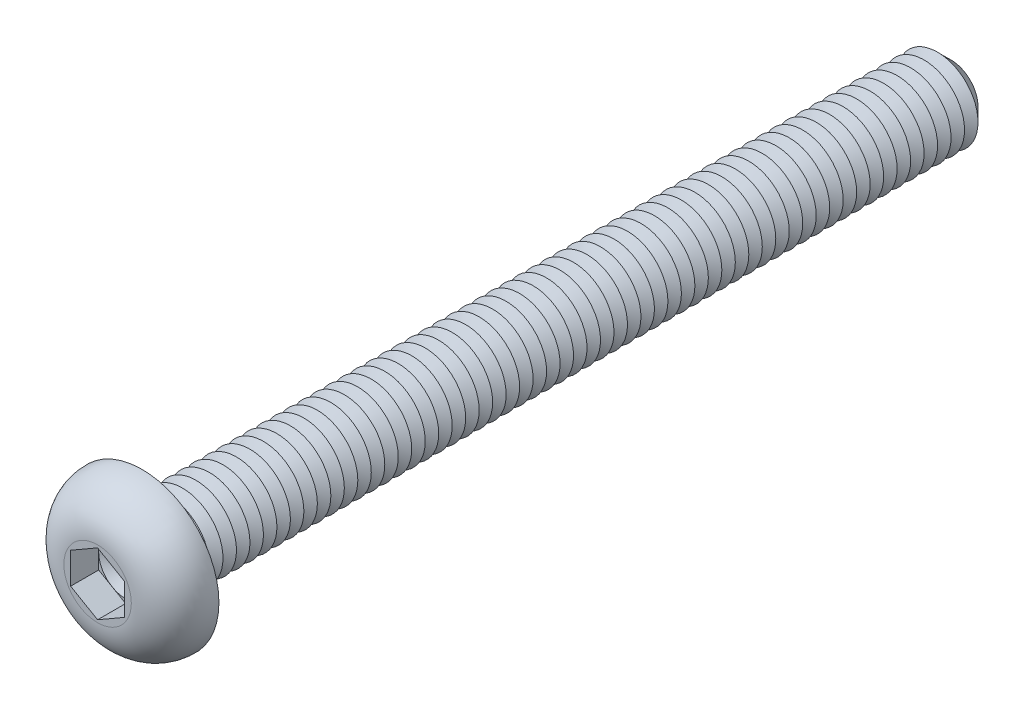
ISO-10303-21;
HEADER;
FILE_DESCRIPTION(('STEP AP214'),'2;1');
FILE_NAME('part.step','',(''),(''),'','','');
FILE_SCHEMA(('AUTOMOTIVE_DESIGN { 1 0 10303 214 1 1 1 1 }'));
ENDSEC;
DATA;
#1=APPLICATION_CONTEXT('core data for automotive mechanical design processes');
#2=APPLICATION_PROTOCOL_DEFINITION('international standard','automotive_design',2000,#1);
#3=PRODUCT_CONTEXT('',#1,'mechanical');
#4=PRODUCT('Part','Part','',(#3));
#5=PRODUCT_RELATED_PRODUCT_CATEGORY('part','',(#4));
#6=PRODUCT_DEFINITION_FORMATION('','',#4);
#7=PRODUCT_DEFINITION_CONTEXT('part definition',#1,'design');
#8=PRODUCT_DEFINITION('design','',#6,#7);
#9=PRODUCT_DEFINITION_SHAPE('','',#8);
#10=(LENGTH_UNIT() NAMED_UNIT(*) SI_UNIT(.MILLI.,.METRE.));
#11=(NAMED_UNIT(*) PLANE_ANGLE_UNIT() SI_UNIT($,.RADIAN.));
#12=(NAMED_UNIT(*) SI_UNIT($,.STERADIAN.) SOLID_ANGLE_UNIT());
#13=UNCERTAINTY_MEASURE_WITH_UNIT(LENGTH_MEASURE(1.E-05),#10,'distance_accuracy_value','');
#14=(GEOMETRIC_REPRESENTATION_CONTEXT(3) GLOBAL_UNCERTAINTY_ASSIGNED_CONTEXT((#13)) GLOBAL_UNIT_ASSIGNED_CONTEXT((#10,
#11,#12)) REPRESENTATION_CONTEXT('',''));
#15=CARTESIAN_POINT('',(0.,0.,0.));
#16=DIRECTION('',(0.,0.,1.));
#17=DIRECTION('',(1.,0.,0.));
#18=AXIS2_PLACEMENT_3D('',#15,#16,#17);
#19=CARTESIAN_POINT('',(0.,0.,0.61));
#20=DIRECTION('',(0.,0.,1.));
#21=DIRECTION('',(1.,0.,0.));
#22=AXIS2_PLACEMENT_3D('',#19,#20,#21);
#23=PLANE('',#22);
#24=CARTESIAN_POINT('',(0.,0.,0.61));
#25=DIRECTION('',(0.,0.,1.));
#26=DIRECTION('',(1.,0.,0.));
#27=AXIS2_PLACEMENT_3D('',#24,#25,#26);
#28=CIRCLE('',#27,1.);
#29=CARTESIAN_POINT('',(1.,0.,0.61));
#30=VERTEX_POINT('',#29);
#31=CARTESIAN_POINT('',(0.5,0.866025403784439,0.61));
#32=VERTEX_POINT('',#31);
#33=EDGE_CURVE('E117',#30,#32,#28,.T.);
#34=ORIENTED_EDGE('',*,*,#33,.F.);
#35=DIRECTION('',(0.,1.,0.));
#36=VECTOR('',#35,1.);
#37=CARTESIAN_POINT('',(1.,-0.577350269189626,0.61));
#38=LINE('',#37,#36);
#39=CARTESIAN_POINT('',(1.,0.577350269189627,0.61));
#40=VERTEX_POINT('',#39);
#41=EDGE_CURVE('E140',#30,#40,#38,.T.);
#42=ORIENTED_EDGE('',*,*,#41,.T.);
#43=DIRECTION('',(-0.866025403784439,0.5,0.));
#44=VECTOR('',#43,1.);
#45=CARTESIAN_POINT('',(1.,0.577350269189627,0.61));
#46=LINE('',#45,#44);
#47=EDGE_CURVE('E135',#40,#32,#46,.T.);
#48=ORIENTED_EDGE('',*,*,#47,.T.);
#49=EDGE_LOOP('',(#34,#42,#48));
#50=FACE_BOUND('',#49,.T.);
#51=ADVANCED_FACE('F39',(#50),#23,.T.);
#52=CARTESIAN_POINT('',(0.,0.,0.61));
#53=DIRECTION('',(0.,0.,1.));
#54=DIRECTION('',(1.,0.,0.));
#55=AXIS2_PLACEMENT_3D('',#52,#53,#54);
#56=CIRCLE('',#55,1.);
#57=CARTESIAN_POINT('',(-0.5,0.866025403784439,0.61));
#58=VERTEX_POINT('',#57);
#59=EDGE_CURVE('E11',#32,#58,#56,.T.);
#60=ORIENTED_EDGE('',*,*,#59,.F.);
#61=CARTESIAN_POINT('',(0.,1.15470053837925,0.61));
#62=VERTEX_POINT('',#61);
#63=EDGE_CURVE('E130',#32,#62,#46,.T.);
#64=ORIENTED_EDGE('',*,*,#63,.T.);
#65=DIRECTION('',(-0.866025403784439,-0.5,0.));
#66=VECTOR('',#65,1.);
#67=CARTESIAN_POINT('',(0.,1.15470053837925,0.61));
#68=LINE('',#67,#66);
#69=EDGE_CURVE('E132',#62,#58,#68,.T.);
#70=ORIENTED_EDGE('',*,*,#69,.T.);
#71=EDGE_LOOP('',(#60,#64,#70));
#72=FACE_BOUND('',#71,.T.);
#73=ADVANCED_FACE('F129',(#72),#23,.T.);
#74=CARTESIAN_POINT('',(-1.,0.,0.61));
#75=VERTEX_POINT('',#74);
#76=EDGE_CURVE('E49',#58,#75,#56,.T.);
#77=ORIENTED_EDGE('',*,*,#76,.F.);
#78=CARTESIAN_POINT('',(-1.,0.577350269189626,0.61));
#79=VERTEX_POINT('',#78);
#80=EDGE_CURVE('E143',#58,#79,#68,.T.);
#81=ORIENTED_EDGE('',*,*,#80,.T.);
#82=DIRECTION('',(0.,-1.,0.));
#83=VECTOR('',#82,1.);
#84=CARTESIAN_POINT('',(-1.,0.577350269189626,0.61));
#85=LINE('',#84,#83);
#86=EDGE_CURVE('E154',#79,#75,#85,.T.);
#87=ORIENTED_EDGE('',*,*,#86,.T.);
#88=EDGE_LOOP('',(#77,#81,#87));
#89=FACE_BOUND('',#88,.T.);
#90=ADVANCED_FACE('F250',(#89),#23,.T.);
#91=CARTESIAN_POINT('',(-0.5,-0.866025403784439,0.61));
#92=VERTEX_POINT('',#91);
#93=EDGE_CURVE('E233',#75,#92,#56,.T.);
#94=ORIENTED_EDGE('',*,*,#93,.F.);
#95=CARTESIAN_POINT('',(-1.,-0.577350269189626,0.61));
#96=VERTEX_POINT('',#95);
#97=EDGE_CURVE('E153',#75,#96,#85,.T.);
#98=ORIENTED_EDGE('',*,*,#97,.T.);
#99=DIRECTION('',(0.866025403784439,-0.5,0.));
#100=VECTOR('',#99,1.);
#101=CARTESIAN_POINT('',(-1.,-0.577350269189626,0.61));
#102=LINE('',#101,#100);
#103=EDGE_CURVE('E159',#96,#92,#102,.T.);
#104=ORIENTED_EDGE('',*,*,#103,.T.);
#105=EDGE_LOOP('',(#94,#98,#104));
#106=FACE_BOUND('',#105,.T.);
#107=ADVANCED_FACE('F244',(#106),#23,.T.);
#108=CARTESIAN_POINT('',(0.5,-0.866025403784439,0.61));
#109=VERTEX_POINT('',#108);
#110=EDGE_CURVE('E56',#92,#109,#56,.T.);
#111=ORIENTED_EDGE('',*,*,#110,.F.);
#112=CARTESIAN_POINT('',(0.,-1.15470053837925,0.61));
#113=VERTEX_POINT('',#112);
#114=EDGE_CURVE('E158',#92,#113,#102,.T.);
#115=ORIENTED_EDGE('',*,*,#114,.T.);
#116=DIRECTION('',(0.866025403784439,0.5,0.));
#117=VECTOR('',#116,1.);
#118=CARTESIAN_POINT('',(0.,-1.15470053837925,0.61));
#119=LINE('',#118,#117);
#120=EDGE_CURVE('E164',#113,#109,#119,.T.);
#121=ORIENTED_EDGE('',*,*,#120,.T.);
#122=EDGE_LOOP('',(#111,#115,#121));
#123=FACE_BOUND('',#122,.T.);
#124=ADVANCED_FACE('F364',(#123),#23,.T.);
#125=CARTESIAN_POINT('',(0.,0.,-30.));
#126=DIRECTION('',(0.,0.,1.));
#127=DIRECTION('',(1.,0.,0.));
#128=AXIS2_PLACEMENT_3D('',#125,#126,#127);
#129=CYLINDRICAL_SURFACE('',#128,1.5);
#130=CARTESIAN_POINT('',(0.,0.,-0.199999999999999));
#131=DIRECTION('',(0.,0.,1.));
#132=DIRECTION('',(1.,0.,0.));
#133=AXIS2_PLACEMENT_3D('',#130,#131,#132);
#134=CIRCLE('',#133,1.5);
#135=CARTESIAN_POINT('',(1.5,0.,-0.199999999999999));
#136=VERTEX_POINT('',#135);
#137=EDGE_CURVE('E221',#136,#136,#134,.F.);
#138=ORIENTED_EDGE('',*,*,#137,.T.);
#139=EDGE_LOOP('',(#138));
#140=FACE_BOUND('',#139,.T.);
#141=CARTESIAN_POINT('',(0.,0.,-0.5));
#142=DIRECTION('',(0.,0.,1.));
#143=DIRECTION('',(1.,0.,0.));
#144=AXIS2_PLACEMENT_3D('',#141,#142,#143);
#145=CIRCLE('',#144,1.50000000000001);
#146=CARTESIAN_POINT('',(1.50000000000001,0.,-0.5));
#147=VERTEX_POINT('',#146);
#148=EDGE_CURVE('E149',#147,#147,#145,.T.);
#149=ORIENTED_EDGE('',*,*,#148,.T.);
#150=EDGE_LOOP('',(#149));
#151=FACE_BOUND('',#150,.T.);
#152=ADVANCED_FACE('F348',(#140,#151),#129,.T.);
#153=CARTESIAN_POINT('',(0.,2.85,0.));
#154=DIRECTION('',(0.,0.,1.));
#155=DIRECTION('',(1.,0.,0.));
#156=AXIS2_PLACEMENT_3D('',#153,#154,#155);
#157=PLANE('',#156);
#158=CARTESIAN_POINT('',(0.,0.,0.));
#159=DIRECTION('',(0.,0.,1.));
#160=DIRECTION('',(1.,0.,0.));
#161=AXIS2_PLACEMENT_3D('',#158,#159,#160);
#162=CIRCLE('',#161,1.7);
#163=CARTESIAN_POINT('',(1.7,0.,0.));
#164=VERTEX_POINT('',#163);
#165=EDGE_CURVE('E224',#164,#164,#162,.T.);
#166=ORIENTED_EDGE('',*,*,#165,.T.);
#167=EDGE_LOOP('',(#166));
#168=FACE_BOUND('',#167,.T.);
#169=CARTESIAN_POINT('',(0.,0.,0.));
#170=DIRECTION('',(0.,0.,1.));
#171=DIRECTION('',(1.,0.,0.));
#172=AXIS2_PLACEMENT_3D('',#169,#170,#171);
#173=CIRCLE('',#172,2.85);
#174=CARTESIAN_POINT('',(2.85,0.,0.));
#175=VERTEX_POINT('',#174);
#176=EDGE_CURVE('E196',#175,#175,#173,.T.);
#177=ORIENTED_EDGE('',*,*,#176,.F.);
#178=EDGE_LOOP('',(#177));
#179=FACE_BOUND('',#178,.T.);
#180=ADVANCED_FACE('F394',(#168,#179),#157,.F.);
#181=CARTESIAN_POINT('',(0.,0.,1.65));
#182=DIRECTION('',(0.,0.,-1.));
#183=DIRECTION('',(-1.,0.,0.));
#184=AXIS2_PLACEMENT_3D('',#181,#182,#183);
#185=PLANE('',#184);
#186=DIRECTION('',(-0.866025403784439,-0.5,0.));
#187=VECTOR('',#186,1.);
#188=CARTESIAN_POINT('',(0.,1.15470053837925,1.65));
#189=LINE('',#188,#187);
#190=CARTESIAN_POINT('',(0.,1.15470053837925,1.65));
#191=VERTEX_POINT('',#190);
#192=CARTESIAN_POINT('',(-1.,0.577350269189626,1.65));
#193=VERTEX_POINT('',#192);
#194=EDGE_CURVE('E174',#191,#193,#189,.T.);
#195=ORIENTED_EDGE('',*,*,#194,.F.);
#196=DIRECTION('',(-0.866025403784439,0.5,0.));
#197=VECTOR('',#196,1.);
#198=CARTESIAN_POINT('',(1.,0.577350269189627,1.65));
#199=LINE('',#198,#197);
#200=CARTESIAN_POINT('',(1.,0.577350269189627,1.65));
#201=VERTEX_POINT('',#200);
#202=EDGE_CURVE('E64',#201,#191,#199,.T.);
#203=ORIENTED_EDGE('',*,*,#202,.F.);
#204=DIRECTION('',(0.,1.,0.));
#205=VECTOR('',#204,1.);
#206=CARTESIAN_POINT('',(1.,-0.577350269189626,1.65));
#207=LINE('',#206,#205);
#208=CARTESIAN_POINT('',(1.,-0.577350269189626,1.65));
#209=VERTEX_POINT('',#208);
#210=EDGE_CURVE('E138',#209,#201,#207,.T.);
#211=ORIENTED_EDGE('',*,*,#210,.F.);
#212=DIRECTION('',(0.866025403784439,0.5,0.));
#213=VECTOR('',#212,1.);
#214=CARTESIAN_POINT('',(0.,-1.15470053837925,1.65));
#215=LINE('',#214,#213);
#216=CARTESIAN_POINT('',(0.,-1.15470053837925,1.65));
#217=VERTEX_POINT('',#216);
#218=EDGE_CURVE('E186',#217,#209,#215,.T.);
#219=ORIENTED_EDGE('',*,*,#218,.F.);
#220=DIRECTION('',(0.866025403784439,-0.5,0.));
#221=VECTOR('',#220,1.);
#222=CARTESIAN_POINT('',(-1.,-0.577350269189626,1.65));
#223=LINE('',#222,#221);
#224=CARTESIAN_POINT('',(-1.,-0.577350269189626,1.65));
#225=VERTEX_POINT('',#224);
#226=EDGE_CURVE('E182',#225,#217,#223,.T.);
#227=ORIENTED_EDGE('',*,*,#226,.F.);
#228=DIRECTION('',(0.,-1.,0.));
#229=VECTOR('',#228,1.);
#230=CARTESIAN_POINT('',(-1.,0.577350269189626,1.65));
#231=LINE('',#230,#229);
#232=EDGE_CURVE('E178',#193,#225,#231,.T.);
#233=ORIENTED_EDGE('',*,*,#232,.F.);
#234=EDGE_LOOP('',(#195,#203,#211,#219,#227,#233));
#235=FACE_BOUND('',#234,.T.);
#236=CARTESIAN_POINT('',(0.,0.,1.65));
#237=DIRECTION('',(0.,0.,1.));
#238=DIRECTION('',(1.,0.,0.));
#239=AXIS2_PLACEMENT_3D('',#236,#237,#238);
#240=CIRCLE('',#239,1.25078144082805);
#241=CARTESIAN_POINT('',(1.25078144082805,0.,1.65));
#242=VERTEX_POINT('',#241);
#243=EDGE_CURVE('E213',#242,#242,#240,.T.);
#244=ORIENTED_EDGE('',*,*,#243,.T.);
#245=EDGE_LOOP('',(#244));
#246=FACE_BOUND('',#245,.T.);
#247=ADVANCED_FACE('F259',(#235,#246),#185,.F.);
#248=CARTESIAN_POINT('',(0.,0.,0.0499999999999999));
#249=DIRECTION('',(0.,0.,1.));
#250=DIRECTION('',(1.,0.,0.));
#251=AXIS2_PLACEMENT_3D('',#248,#249,#250);
#252=DEGENERATE_TOROIDAL_SURFACE('',#251,1.25078144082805,1.6,.T.);
#253=ORIENTED_EDGE('',*,*,#243,.F.);
#254=EDGE_LOOP('',(#253));
#255=FACE_BOUND('',#254,.T.);
#256=ORIENTED_EDGE('',*,*,#176,.T.);
#257=EDGE_LOOP('',(#256));
#258=FACE_BOUND('',#257,.T.);
#259=ADVANCED_FACE('F388',(#255,#258),#252,.T.);
#260=CARTESIAN_POINT('',(1.,0.577350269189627,0.61));
#261=DIRECTION('',(0.5,0.866025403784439,0.));
#262=DIRECTION('',(-0.866025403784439,0.5,0.));
#263=AXIS2_PLACEMENT_3D('',#260,#261,#262);
#264=PLANE('',#263);
#265=ORIENTED_EDGE('',*,*,#202,.T.);
#266=DIRECTION('',(0.,0.,1.));
#267=VECTOR('',#266,1.);
#268=CARTESIAN_POINT('',(0.,1.15470053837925,0.61));
#269=LINE('',#268,#267);
#270=EDGE_CURVE('E136',#62,#191,#269,.T.);
#271=ORIENTED_EDGE('',*,*,#270,.F.);
#272=ORIENTED_EDGE('',*,*,#63,.F.);
#273=ORIENTED_EDGE('',*,*,#47,.F.);
#274=DIRECTION('',(0.,0.,1.));
#275=VECTOR('',#274,1.);
#276=CARTESIAN_POINT('',(1.,0.577350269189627,0.61));
#277=LINE('',#276,#275);
#278=EDGE_CURVE('E193',#40,#201,#277,.T.);
#279=ORIENTED_EDGE('',*,*,#278,.T.);
#280=EDGE_LOOP('',(#265,#271,#272,#273,#279));
#281=FACE_BOUND('',#280,.T.);
#282=ADVANCED_FACE('F134',(#281),#264,.F.);
#283=CARTESIAN_POINT('',(1.,-0.577350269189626,0.61));
#284=DIRECTION('',(1.,0.,0.));
#285=DIRECTION('',(0.,0.,-1.));
#286=AXIS2_PLACEMENT_3D('',#283,#284,#285);
#287=PLANE('',#286);
#288=ORIENTED_EDGE('',*,*,#210,.T.);
#289=ORIENTED_EDGE('',*,*,#278,.F.);
#290=ORIENTED_EDGE('',*,*,#41,.F.);
#291=CARTESIAN_POINT('',(1.,-0.577350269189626,0.61));
#292=VERTEX_POINT('',#291);
#293=EDGE_CURVE('E168',#292,#30,#38,.T.);
#294=ORIENTED_EDGE('',*,*,#293,.F.);
#295=DIRECTION('',(0.,0.,1.));
#296=VECTOR('',#295,1.);
#297=CARTESIAN_POINT('',(1.,-0.577350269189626,0.61));
#298=LINE('',#297,#296);
#299=EDGE_CURVE('E197',#292,#209,#298,.T.);
#300=ORIENTED_EDGE('',*,*,#299,.T.);
#301=EDGE_LOOP('',(#288,#289,#290,#294,#300));
#302=FACE_BOUND('',#301,.T.);
#303=ADVANCED_FACE('F372',(#302),#287,.F.);
#304=CARTESIAN_POINT('',(0.,-1.15470053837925,0.61));
#305=DIRECTION('',(0.5,-0.866025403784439,0.));
#306=DIRECTION('',(0.866025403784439,0.5,0.));
#307=AXIS2_PLACEMENT_3D('',#304,#305,#306);
#308=PLANE('',#307);
#309=ORIENTED_EDGE('',*,*,#218,.T.);
#310=ORIENTED_EDGE('',*,*,#299,.F.);
#311=EDGE_CURVE('E163',#109,#292,#119,.T.);
#312=ORIENTED_EDGE('',*,*,#311,.F.);
#313=ORIENTED_EDGE('',*,*,#120,.F.);
#314=DIRECTION('',(0.,0.,1.));
#315=VECTOR('',#314,1.);
#316=CARTESIAN_POINT('',(0.,-1.15470053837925,0.61));
#317=LINE('',#316,#315);
#318=EDGE_CURVE('E200',#113,#217,#317,.T.);
#319=ORIENTED_EDGE('',*,*,#318,.T.);
#320=EDGE_LOOP('',(#309,#310,#312,#313,#319));
#321=FACE_BOUND('',#320,.T.);
#322=ADVANCED_FACE('F375',(#321),#308,.F.);
#323=CARTESIAN_POINT('',(-1.,-0.577350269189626,0.61));
#324=DIRECTION('',(-0.5,-0.866025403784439,0.));
#325=DIRECTION('',(0.866025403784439,-0.5,0.));
#326=AXIS2_PLACEMENT_3D('',#323,#324,#325);
#327=PLANE('',#326);
#328=ORIENTED_EDGE('',*,*,#226,.T.);
#329=ORIENTED_EDGE('',*,*,#318,.F.);
#330=ORIENTED_EDGE('',*,*,#114,.F.);
#331=ORIENTED_EDGE('',*,*,#103,.F.);
#332=DIRECTION('',(0.,0.,1.));
#333=VECTOR('',#332,1.);
#334=CARTESIAN_POINT('',(-1.,-0.577350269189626,0.61));
#335=LINE('',#334,#333);
#336=EDGE_CURVE('E203',#96,#225,#335,.T.);
#337=ORIENTED_EDGE('',*,*,#336,.T.);
#338=EDGE_LOOP('',(#328,#329,#330,#331,#337));
#339=FACE_BOUND('',#338,.T.);
#340=ADVANCED_FACE('F264',(#339),#327,.F.);
#341=CARTESIAN_POINT('',(-1.,0.577350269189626,0.61));
#342=DIRECTION('',(-1.,0.,0.));
#343=DIRECTION('',(0.,-1.,0.));
#344=AXIS2_PLACEMENT_3D('',#341,#342,#343);
#345=PLANE('',#344);
#346=ORIENTED_EDGE('',*,*,#232,.T.);
#347=ORIENTED_EDGE('',*,*,#336,.F.);
#348=ORIENTED_EDGE('',*,*,#97,.F.);
#349=ORIENTED_EDGE('',*,*,#86,.F.);
#350=DIRECTION('',(0.,0.,1.));
#351=VECTOR('',#350,1.);
#352=CARTESIAN_POINT('',(-1.,0.577350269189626,0.61));
#353=LINE('',#352,#351);
#354=EDGE_CURVE('E206',#79,#193,#353,.T.);
#355=ORIENTED_EDGE('',*,*,#354,.T.);
#356=EDGE_LOOP('',(#346,#347,#348,#349,#355));
#357=FACE_BOUND('',#356,.T.);
#358=ADVANCED_FACE('F249',(#357),#345,.F.);
#359=CARTESIAN_POINT('',(0.,1.15470053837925,0.61));
#360=DIRECTION('',(-0.5,0.866025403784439,0.));
#361=DIRECTION('',(-0.866025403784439,-0.5,0.));
#362=AXIS2_PLACEMENT_3D('',#359,#360,#361);
#363=PLANE('',#362);
#364=ORIENTED_EDGE('',*,*,#194,.T.);
#365=ORIENTED_EDGE('',*,*,#354,.F.);
#366=ORIENTED_EDGE('',*,*,#80,.F.);
#367=ORIENTED_EDGE('',*,*,#69,.F.);
#368=ORIENTED_EDGE('',*,*,#270,.T.);
#369=EDGE_LOOP('',(#364,#365,#366,#367,#368));
#370=FACE_BOUND('',#369,.T.);
#371=ADVANCED_FACE('F253',(#370),#363,.F.);
#372=EDGE_CURVE('E43',#109,#30,#56,.T.);
#373=ORIENTED_EDGE('',*,*,#372,.F.);
#374=ORIENTED_EDGE('',*,*,#311,.T.);
#375=ORIENTED_EDGE('',*,*,#293,.T.);
#376=EDGE_LOOP('',(#373,#374,#375));
#377=FACE_BOUND('',#376,.T.);
#378=ADVANCED_FACE('F353',(#377),#23,.T.);
#379=CARTESIAN_POINT('',(0.,0.,-0.5));
#380=DIRECTION('',(0.,0.,1.));
#381=DIRECTION('',(1.,0.,0.));
#382=AXIS2_PLACEMENT_3D('',#379,#380,#381);
#383=CONICAL_SURFACE('',#382,1.50000000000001,1.0471975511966);
#384=CARTESIAN_POINT('',(0.,0.,-0.750000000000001));
#385=DIRECTION('',(0.,0.,1.));
#386=DIRECTION('',(1.,0.,0.));
#387=AXIS2_PLACEMENT_3D('',#384,#385,#386);
#388=CIRCLE('',#387,1.06698729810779);
#389=CARTESIAN_POINT('',(1.06698729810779,0.,-0.750000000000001));
#390=VERTEX_POINT('',#389);
#391=EDGE_CURVE('E337',#390,#390,#388,.T.);
#392=ORIENTED_EDGE('',*,*,#391,.T.);
#393=EDGE_LOOP('',(#392));
#394=FACE_BOUND('',#393,.T.);
#395=ORIENTED_EDGE('',*,*,#148,.F.);
#396=EDGE_LOOP('',(#395));
#397=FACE_BOUND('',#396,.T.);
#398=ADVANCED_FACE('F350',(#394,#397),#383,.T.);
#399=CARTESIAN_POINT('',(0.,0.,-0.750000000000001));
#400=DIRECTION('',(0.,0.,-1.));
#401=DIRECTION('',(-1.,0.,0.));
#402=AXIS2_PLACEMENT_3D('',#399,#400,#401);
#403=CONICAL_SURFACE('',#402,1.06698729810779,1.0471975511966);
#404=CARTESIAN_POINT('',(0.,0.,-1.));
#405=DIRECTION('',(0.,0.,1.));
#406=DIRECTION('',(1.,0.,0.));
#407=AXIS2_PLACEMENT_3D('',#404,#405,#406);
#408=CIRCLE('',#407,1.50000000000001);
#409=CARTESIAN_POINT('',(1.50000000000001,0.,-1.));
#410=VERTEX_POINT('',#409);
#411=EDGE_CURVE('E334',#410,#410,#408,.T.);
#412=ORIENTED_EDGE('',*,*,#411,.T.);
#413=EDGE_LOOP('',(#412));
#414=FACE_BOUND('',#413,.T.);
#415=ORIENTED_EDGE('',*,*,#391,.F.);
#416=EDGE_LOOP('',(#415));
#417=FACE_BOUND('',#416,.T.);
#418=ADVANCED_FACE('F352',(#414,#417),#403,.T.);
#419=CARTESIAN_POINT('',(0.,0.,-1.));
#420=DIRECTION('',(0.,0.,1.));
#421=DIRECTION('',(1.,0.,0.));
#422=AXIS2_PLACEMENT_3D('',#419,#420,#421);
#423=CONICAL_SURFACE('',#422,1.50000000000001,1.0471975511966);
#424=CARTESIAN_POINT('',(0.,0.,-1.25));
#425=DIRECTION('',(0.,0.,1.));
#426=DIRECTION('',(1.,0.,0.));
#427=AXIS2_PLACEMENT_3D('',#424,#425,#426);
#428=CIRCLE('',#427,1.06698729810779);
#429=CARTESIAN_POINT('',(1.06698729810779,0.,-1.25));
#430=VERTEX_POINT('',#429);
#431=EDGE_CURVE('E330',#430,#430,#428,.T.);
#432=ORIENTED_EDGE('',*,*,#431,.T.);
#433=EDGE_LOOP('',(#432));
#434=FACE_BOUND('',#433,.T.);
#435=ORIENTED_EDGE('',*,*,#411,.F.);
#436=EDGE_LOOP('',(#435));
#437=FACE_BOUND('',#436,.T.);
#438=ADVANCED_FACE('F359',(#434,#437),#423,.T.);
#439=CARTESIAN_POINT('',(0.,0.,-1.25));
#440=DIRECTION('',(0.,0.,-1.));
#441=DIRECTION('',(-1.,0.,0.));
#442=AXIS2_PLACEMENT_3D('',#439,#440,#441);
#443=CONICAL_SURFACE('',#442,1.06698729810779,1.0471975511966);
#444=CARTESIAN_POINT('',(0.,0.,-1.5));
#445=DIRECTION('',(0.,0.,1.));
#446=DIRECTION('',(1.,0.,0.));
#447=AXIS2_PLACEMENT_3D('',#444,#445,#446);
#448=CIRCLE('',#447,1.50000000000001);
#449=CARTESIAN_POINT('',(1.50000000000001,0.,-1.5));
#450=VERTEX_POINT('',#449);
#451=EDGE_CURVE('E326',#450,#450,#448,.T.);
#452=ORIENTED_EDGE('',*,*,#451,.T.);
#453=EDGE_LOOP('',(#452));
#454=FACE_BOUND('',#453,.T.);
#455=ORIENTED_EDGE('',*,*,#431,.F.);
#456=EDGE_LOOP('',(#455));
#457=FACE_BOUND('',#456,.T.);
#458=ADVANCED_FACE('F839',(#454,#457),#443,.T.);
#459=CARTESIAN_POINT('',(0.,0.,-1.5));
#460=DIRECTION('',(0.,0.,1.));
#461=DIRECTION('',(1.,0.,0.));
#462=AXIS2_PLACEMENT_3D('',#459,#460,#461);
#463=CONICAL_SURFACE('',#462,1.50000000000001,1.0471975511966);
#464=CARTESIAN_POINT('',(0.,0.,-1.75));
#465=DIRECTION('',(0.,0.,1.));
#466=DIRECTION('',(1.,0.,0.));
#467=AXIS2_PLACEMENT_3D('',#464,#465,#466);
#468=CIRCLE('',#467,1.06698729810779);
#469=CARTESIAN_POINT('',(1.06698729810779,0.,-1.75));
#470=VERTEX_POINT('',#469);
#471=EDGE_CURVE('E322',#470,#470,#468,.T.);
#472=ORIENTED_EDGE('',*,*,#471,.T.);
#473=EDGE_LOOP('',(#472));
#474=FACE_BOUND('',#473,.T.);
#475=ORIENTED_EDGE('',*,*,#451,.F.);
#476=EDGE_LOOP('',(#475));
#477=FACE_BOUND('',#476,.T.);
#478=ADVANCED_FACE('F835',(#474,#477),#463,.T.);
#479=CARTESIAN_POINT('',(0.,0.,-1.75));
#480=DIRECTION('',(0.,0.,-1.));
#481=DIRECTION('',(-1.,0.,0.));
#482=AXIS2_PLACEMENT_3D('',#479,#480,#481);
#483=CONICAL_SURFACE('',#482,1.06698729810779,1.0471975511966);
#484=CARTESIAN_POINT('',(0.,0.,-2.));
#485=DIRECTION('',(0.,0.,1.));
#486=DIRECTION('',(1.,0.,0.));
#487=AXIS2_PLACEMENT_3D('',#484,#485,#486);
#488=CIRCLE('',#487,1.50000000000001);
#489=CARTESIAN_POINT('',(1.50000000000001,0.,-2.));
#490=VERTEX_POINT('',#489);
#491=EDGE_CURVE('E271',#490,#490,#488,.T.);
#492=ORIENTED_EDGE('',*,*,#491,.T.);
#493=EDGE_LOOP('',(#492));
#494=FACE_BOUND('',#493,.T.);
#495=ORIENTED_EDGE('',*,*,#471,.F.);
#496=EDGE_LOOP('',(#495));
#497=FACE_BOUND('',#496,.T.);
#498=ADVANCED_FACE('F831',(#494,#497),#483,.T.);
#499=CARTESIAN_POINT('',(0.,0.,-2.));
#500=DIRECTION('',(0.,0.,1.));
#501=DIRECTION('',(1.,0.,0.));
#502=AXIS2_PLACEMENT_3D('',#499,#500,#501);
#503=CONICAL_SURFACE('',#502,1.50000000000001,1.0471975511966);
#504=CARTESIAN_POINT('',(0.,0.,-2.25));
#505=DIRECTION('',(0.,0.,1.));
#506=DIRECTION('',(1.,0.,0.));
#507=AXIS2_PLACEMENT_3D('',#504,#505,#506);
#508=CIRCLE('',#507,1.06698729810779);
#509=CARTESIAN_POINT('',(1.06698729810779,0.,-2.25));
#510=VERTEX_POINT('',#509);
#511=EDGE_CURVE('E310',#510,#510,#508,.T.);
#512=ORIENTED_EDGE('',*,*,#511,.T.);
#513=EDGE_LOOP('',(#512));
#514=FACE_BOUND('',#513,.T.);
#515=ORIENTED_EDGE('',*,*,#491,.F.);
#516=EDGE_LOOP('',(#515));
#517=FACE_BOUND('',#516,.T.);
#518=ADVANCED_FACE('F827',(#514,#517),#503,.T.);
#519=CARTESIAN_POINT('',(0.,0.,-2.25));
#520=DIRECTION('',(0.,0.,-1.));
#521=DIRECTION('',(-1.,0.,0.));
#522=AXIS2_PLACEMENT_3D('',#519,#520,#521);
#523=CONICAL_SURFACE('',#522,1.06698729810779,1.0471975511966);
#524=CARTESIAN_POINT('',(0.,0.,-2.5));
#525=DIRECTION('',(0.,0.,1.));
#526=DIRECTION('',(1.,0.,0.));
#527=AXIS2_PLACEMENT_3D('',#524,#525,#526);
#528=CIRCLE('',#527,1.50000000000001);
#529=CARTESIAN_POINT('',(1.50000000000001,0.,-2.5));
#530=VERTEX_POINT('',#529);
#531=EDGE_CURVE('E304',#530,#530,#528,.T.);
#532=ORIENTED_EDGE('',*,*,#531,.T.);
#533=EDGE_LOOP('',(#532));
#534=FACE_BOUND('',#533,.T.);
#535=ORIENTED_EDGE('',*,*,#511,.F.);
#536=EDGE_LOOP('',(#535));
#537=FACE_BOUND('',#536,.T.);
#538=ADVANCED_FACE('F824',(#534,#537),#523,.T.);
#539=CARTESIAN_POINT('',(0.,0.,-2.5));
#540=DIRECTION('',(0.,0.,1.));
#541=DIRECTION('',(1.,0.,0.));
#542=AXIS2_PLACEMENT_3D('',#539,#540,#541);
#543=CONICAL_SURFACE('',#542,1.50000000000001,1.0471975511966);
#544=CARTESIAN_POINT('',(0.,0.,-2.75));
#545=DIRECTION('',(0.,0.,1.));
#546=DIRECTION('',(1.,0.,0.));
#547=AXIS2_PLACEMENT_3D('',#544,#545,#546);
#548=CIRCLE('',#547,1.06698729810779);
#549=CARTESIAN_POINT('',(1.06698729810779,0.,-2.75));
#550=VERTEX_POINT('',#549);
#551=EDGE_CURVE('E302',#550,#550,#548,.T.);
#552=ORIENTED_EDGE('',*,*,#551,.T.);
#553=EDGE_LOOP('',(#552));
#554=FACE_BOUND('',#553,.T.);
#555=ORIENTED_EDGE('',*,*,#531,.F.);
#556=EDGE_LOOP('',(#555));
#557=FACE_BOUND('',#556,.T.);
#558=ADVANCED_FACE('F820',(#554,#557),#543,.T.);
#559=CARTESIAN_POINT('',(0.,0.,-2.75));
#560=DIRECTION('',(0.,0.,-1.));
#561=DIRECTION('',(-1.,0.,0.));
#562=AXIS2_PLACEMENT_3D('',#559,#560,#561);
#563=CONICAL_SURFACE('',#562,1.06698729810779,1.0471975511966);
#564=CARTESIAN_POINT('',(0.,0.,-3.));
#565=DIRECTION('',(0.,0.,1.));
#566=DIRECTION('',(1.,0.,0.));
#567=AXIS2_PLACEMENT_3D('',#564,#565,#566);
#568=CIRCLE('',#567,1.50000000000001);
#569=CARTESIAN_POINT('',(1.50000000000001,0.,-3.));
#570=VERTEX_POINT('',#569);
#571=EDGE_CURVE('E305',#570,#570,#568,.T.);
#572=ORIENTED_EDGE('',*,*,#571,.T.);
#573=EDGE_LOOP('',(#572));
#574=FACE_BOUND('',#573,.T.);
#575=ORIENTED_EDGE('',*,*,#551,.F.);
#576=EDGE_LOOP('',(#575));
#577=FACE_BOUND('',#576,.T.);
#578=ADVANCED_FACE('F814',(#574,#577),#563,.T.);
#579=CARTESIAN_POINT('',(0.,0.,-3.));
#580=DIRECTION('',(0.,0.,1.));
#581=DIRECTION('',(1.,0.,0.));
#582=AXIS2_PLACEMENT_3D('',#579,#580,#581);
#583=CONICAL_SURFACE('',#582,1.50000000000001,1.0471975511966);
#584=CARTESIAN_POINT('',(0.,0.,-3.25));
#585=DIRECTION('',(0.,0.,1.));
#586=DIRECTION('',(1.,0.,0.));
#587=AXIS2_PLACEMENT_3D('',#584,#585,#586);
#588=CIRCLE('',#587,1.06698729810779);
#589=CARTESIAN_POINT('',(1.06698729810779,0.,-3.25));
#590=VERTEX_POINT('',#589);
#591=EDGE_CURVE('E314',#590,#590,#588,.T.);
#592=ORIENTED_EDGE('',*,*,#591,.T.);
#593=EDGE_LOOP('',(#592));
#594=FACE_BOUND('',#593,.T.);
#595=ORIENTED_EDGE('',*,*,#571,.F.);
#596=EDGE_LOOP('',(#595));
#597=FACE_BOUND('',#596,.T.);
#598=ADVANCED_FACE('F799',(#594,#597),#583,.T.);
#599=CARTESIAN_POINT('',(0.,0.,-3.25));
#600=DIRECTION('',(0.,0.,-1.));
#601=DIRECTION('',(-1.,0.,0.));
#602=AXIS2_PLACEMENT_3D('',#599,#600,#601);
#603=CONICAL_SURFACE('',#602,1.06698729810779,1.0471975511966);
#604=CARTESIAN_POINT('',(0.,0.,-3.5));
#605=DIRECTION('',(0.,0.,1.));
#606=DIRECTION('',(1.,0.,0.));
#607=AXIS2_PLACEMENT_3D('',#604,#605,#606);
#608=CIRCLE('',#607,1.50000000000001);
#609=CARTESIAN_POINT('',(1.50000000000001,0.,-3.5));
#610=VERTEX_POINT('',#609);
#611=EDGE_CURVE('E792',#610,#610,#608,.T.);
#612=ORIENTED_EDGE('',*,*,#611,.T.);
#613=EDGE_LOOP('',(#612));
#614=FACE_BOUND('',#613,.T.);
#615=ORIENTED_EDGE('',*,*,#591,.F.);
#616=EDGE_LOOP('',(#615));
#617=FACE_BOUND('',#616,.T.);
#618=ADVANCED_FACE('F802',(#614,#617),#603,.T.);
#619=CARTESIAN_POINT('',(0.,0.,-3.5));
#620=DIRECTION('',(0.,0.,1.));
#621=DIRECTION('',(1.,0.,0.));
#622=AXIS2_PLACEMENT_3D('',#619,#620,#621);
#623=CONICAL_SURFACE('',#622,1.50000000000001,1.0471975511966);
#624=CARTESIAN_POINT('',(0.,0.,-3.75));
#625=DIRECTION('',(0.,0.,1.));
#626=DIRECTION('',(1.,0.,0.));
#627=AXIS2_PLACEMENT_3D('',#624,#625,#626);
#628=CIRCLE('',#627,1.06698729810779);
#629=CARTESIAN_POINT('',(1.06698729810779,0.,-3.75));
#630=VERTEX_POINT('',#629);
#631=EDGE_CURVE('E788',#630,#630,#628,.T.);
#632=ORIENTED_EDGE('',*,*,#631,.T.);
#633=EDGE_LOOP('',(#632));
#634=FACE_BOUND('',#633,.T.);
#635=ORIENTED_EDGE('',*,*,#611,.F.);
#636=EDGE_LOOP('',(#635));
#637=FACE_BOUND('',#636,.T.);
#638=ADVANCED_FACE('F804',(#634,#637),#623,.T.);
#639=CARTESIAN_POINT('',(0.,0.,-3.75));
#640=DIRECTION('',(0.,0.,-1.));
#641=DIRECTION('',(-1.,0.,0.));
#642=AXIS2_PLACEMENT_3D('',#639,#640,#641);
#643=CONICAL_SURFACE('',#642,1.06698729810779,1.0471975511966);
#644=CARTESIAN_POINT('',(0.,0.,-4.));
#645=DIRECTION('',(0.,0.,1.));
#646=DIRECTION('',(1.,0.,0.));
#647=AXIS2_PLACEMENT_3D('',#644,#645,#646);
#648=CIRCLE('',#647,1.50000000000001);
#649=CARTESIAN_POINT('',(1.50000000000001,0.,-4.));
#650=VERTEX_POINT('',#649);
#651=EDGE_CURVE('E784',#650,#650,#648,.T.);
#652=ORIENTED_EDGE('',*,*,#651,.T.);
#653=EDGE_LOOP('',(#652));
#654=FACE_BOUND('',#653,.T.);
#655=ORIENTED_EDGE('',*,*,#631,.F.);
#656=EDGE_LOOP('',(#655));
#657=FACE_BOUND('',#656,.T.);
#658=ADVANCED_FACE('F811',(#654,#657),#643,.T.);
#659=CARTESIAN_POINT('',(0.,0.,-4.));
#660=DIRECTION('',(0.,0.,1.));
#661=DIRECTION('',(1.,0.,0.));
#662=AXIS2_PLACEMENT_3D('',#659,#660,#661);
#663=CONICAL_SURFACE('',#662,1.50000000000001,1.0471975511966);
#664=CARTESIAN_POINT('',(0.,0.,-4.25));
#665=DIRECTION('',(0.,0.,1.));
#666=DIRECTION('',(1.,0.,0.));
#667=AXIS2_PLACEMENT_3D('',#664,#665,#666);
#668=CIRCLE('',#667,1.06698729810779);
#669=CARTESIAN_POINT('',(1.06698729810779,0.,-4.25));
#670=VERTEX_POINT('',#669);
#671=EDGE_CURVE('E780',#670,#670,#668,.T.);
#672=ORIENTED_EDGE('',*,*,#671,.T.);
#673=EDGE_LOOP('',(#672));
#674=FACE_BOUND('',#673,.T.);
#675=ORIENTED_EDGE('',*,*,#651,.F.);
#676=EDGE_LOOP('',(#675));
#677=FACE_BOUND('',#676,.T.);
#678=ADVANCED_FACE('F894',(#674,#677),#663,.T.);
#679=CARTESIAN_POINT('',(0.,0.,-4.25));
#680=DIRECTION('',(0.,0.,-1.));
#681=DIRECTION('',(-1.,0.,0.));
#682=AXIS2_PLACEMENT_3D('',#679,#680,#681);
#683=CONICAL_SURFACE('',#682,1.06698729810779,1.0471975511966);
#684=CARTESIAN_POINT('',(0.,0.,-4.5));
#685=DIRECTION('',(0.,0.,1.));
#686=DIRECTION('',(1.,0.,0.));
#687=AXIS2_PLACEMENT_3D('',#684,#685,#686);
#688=CIRCLE('',#687,1.50000000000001);
#689=CARTESIAN_POINT('',(1.50000000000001,0.,-4.5));
#690=VERTEX_POINT('',#689);
#691=EDGE_CURVE('E776',#690,#690,#688,.T.);
#692=ORIENTED_EDGE('',*,*,#691,.T.);
#693=EDGE_LOOP('',(#692));
#694=FACE_BOUND('',#693,.T.);
#695=ORIENTED_EDGE('',*,*,#671,.F.);
#696=EDGE_LOOP('',(#695));
#697=FACE_BOUND('',#696,.T.);
#698=ADVANCED_FACE('F902',(#694,#697),#683,.T.);
#699=CARTESIAN_POINT('',(0.,0.,-4.5));
#700=DIRECTION('',(0.,0.,1.));
#701=DIRECTION('',(1.,0.,0.));
#702=AXIS2_PLACEMENT_3D('',#699,#700,#701);
#703=CONICAL_SURFACE('',#702,1.50000000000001,1.0471975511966);
#704=CARTESIAN_POINT('',(0.,0.,-4.75));
#705=DIRECTION('',(0.,0.,1.));
#706=DIRECTION('',(1.,0.,0.));
#707=AXIS2_PLACEMENT_3D('',#704,#705,#706);
#708=CIRCLE('',#707,1.06698729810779);
#709=CARTESIAN_POINT('',(1.06698729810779,0.,-4.75));
#710=VERTEX_POINT('',#709);
#711=EDGE_CURVE('E772',#710,#710,#708,.T.);
#712=ORIENTED_EDGE('',*,*,#711,.T.);
#713=EDGE_LOOP('',(#712));
#714=FACE_BOUND('',#713,.T.);
#715=ORIENTED_EDGE('',*,*,#691,.F.);
#716=EDGE_LOOP('',(#715));
#717=FACE_BOUND('',#716,.T.);
#718=ADVANCED_FACE('F911',(#714,#717),#703,.T.);
#719=CARTESIAN_POINT('',(0.,0.,-4.75));
#720=DIRECTION('',(0.,0.,-1.));
#721=DIRECTION('',(-1.,0.,0.));
#722=AXIS2_PLACEMENT_3D('',#719,#720,#721);
#723=CONICAL_SURFACE('',#722,1.06698729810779,1.0471975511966);
#724=CARTESIAN_POINT('',(0.,0.,-5.));
#725=DIRECTION('',(0.,0.,1.));
#726=DIRECTION('',(1.,0.,0.));
#727=AXIS2_PLACEMENT_3D('',#724,#725,#726);
#728=CIRCLE('',#727,1.50000000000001);
#729=CARTESIAN_POINT('',(1.50000000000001,0.,-5.));
#730=VERTEX_POINT('',#729);
#731=EDGE_CURVE('E768',#730,#730,#728,.T.);
#732=ORIENTED_EDGE('',*,*,#731,.T.);
#733=EDGE_LOOP('',(#732));
#734=FACE_BOUND('',#733,.T.);
#735=ORIENTED_EDGE('',*,*,#711,.F.);
#736=EDGE_LOOP('',(#735));
#737=FACE_BOUND('',#736,.T.);
#738=ADVANCED_FACE('F920',(#734,#737),#723,.T.);
#739=CARTESIAN_POINT('',(0.,0.,-5.));
#740=DIRECTION('',(0.,0.,1.));
#741=DIRECTION('',(1.,0.,0.));
#742=AXIS2_PLACEMENT_3D('',#739,#740,#741);
#743=CONICAL_SURFACE('',#742,1.50000000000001,1.0471975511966);
#744=CARTESIAN_POINT('',(0.,0.,-5.25));
#745=DIRECTION('',(0.,0.,1.));
#746=DIRECTION('',(1.,0.,0.));
#747=AXIS2_PLACEMENT_3D('',#744,#745,#746);
#748=CIRCLE('',#747,1.06698729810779);
#749=CARTESIAN_POINT('',(1.06698729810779,0.,-5.25));
#750=VERTEX_POINT('',#749);
#751=EDGE_CURVE('E765',#750,#750,#748,.T.);
#752=ORIENTED_EDGE('',*,*,#751,.T.);
#753=EDGE_LOOP('',(#752));
#754=FACE_BOUND('',#753,.T.);
#755=ORIENTED_EDGE('',*,*,#731,.F.);
#756=EDGE_LOOP('',(#755));
#757=FACE_BOUND('',#756,.T.);
#758=ADVANCED_FACE('F929',(#754,#757),#743,.T.);
#759=CARTESIAN_POINT('',(0.,0.,-5.25));
#760=DIRECTION('',(0.,0.,-1.));
#761=DIRECTION('',(-1.,0.,0.));
#762=AXIS2_PLACEMENT_3D('',#759,#760,#761);
#763=CONICAL_SURFACE('',#762,1.06698729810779,1.0471975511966);
#764=CARTESIAN_POINT('',(0.,0.,-5.5));
#765=DIRECTION('',(0.,0.,1.));
#766=DIRECTION('',(1.,0.,0.));
#767=AXIS2_PLACEMENT_3D('',#764,#765,#766);
#768=CIRCLE('',#767,1.50000000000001);
#769=CARTESIAN_POINT('',(1.50000000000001,0.,-5.5));
#770=VERTEX_POINT('',#769);
#771=EDGE_CURVE('E762',#770,#770,#768,.T.);
#772=ORIENTED_EDGE('',*,*,#771,.T.);
#773=EDGE_LOOP('',(#772));
#774=FACE_BOUND('',#773,.T.);
#775=ORIENTED_EDGE('',*,*,#751,.F.);
#776=EDGE_LOOP('',(#775));
#777=FACE_BOUND('',#776,.T.);
#778=ADVANCED_FACE('F938',(#774,#777),#763,.T.);
#779=CARTESIAN_POINT('',(0.,0.,-5.5));
#780=DIRECTION('',(0.,0.,1.));
#781=DIRECTION('',(1.,0.,0.));
#782=AXIS2_PLACEMENT_3D('',#779,#780,#781);
#783=CONICAL_SURFACE('',#782,1.50000000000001,1.0471975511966);
#784=CARTESIAN_POINT('',(0.,0.,-5.75));
#785=DIRECTION('',(0.,0.,1.));
#786=DIRECTION('',(1.,0.,0.));
#787=AXIS2_PLACEMENT_3D('',#784,#785,#786);
#788=CIRCLE('',#787,1.06698729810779);
#789=CARTESIAN_POINT('',(1.06698729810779,0.,-5.75));
#790=VERTEX_POINT('',#789);
#791=EDGE_CURVE('E759',#790,#790,#788,.T.);
#792=ORIENTED_EDGE('',*,*,#791,.T.);
#793=EDGE_LOOP('',(#792));
#794=FACE_BOUND('',#793,.T.);
#795=ORIENTED_EDGE('',*,*,#771,.F.);
#796=EDGE_LOOP('',(#795));
#797=FACE_BOUND('',#796,.T.);
#798=ADVANCED_FACE('F947',(#794,#797),#783,.T.);
#799=CARTESIAN_POINT('',(0.,0.,-5.75));
#800=DIRECTION('',(0.,0.,-1.));
#801=DIRECTION('',(-1.,0.,0.));
#802=AXIS2_PLACEMENT_3D('',#799,#800,#801);
#803=CONICAL_SURFACE('',#802,1.06698729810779,1.0471975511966);
#804=CARTESIAN_POINT('',(0.,0.,-6.));
#805=DIRECTION('',(0.,0.,1.));
#806=DIRECTION('',(1.,0.,0.));
#807=AXIS2_PLACEMENT_3D('',#804,#805,#806);
#808=CIRCLE('',#807,1.50000000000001);
#809=CARTESIAN_POINT('',(1.50000000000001,0.,-6.));
#810=VERTEX_POINT('',#809);
#811=EDGE_CURVE('E755',#810,#810,#808,.T.);
#812=ORIENTED_EDGE('',*,*,#811,.T.);
#813=EDGE_LOOP('',(#812));
#814=FACE_BOUND('',#813,.T.);
#815=ORIENTED_EDGE('',*,*,#791,.F.);
#816=EDGE_LOOP('',(#815));
#817=FACE_BOUND('',#816,.T.);
#818=ADVANCED_FACE('F956',(#814,#817),#803,.T.);
#819=CARTESIAN_POINT('',(0.,0.,-6.));
#820=DIRECTION('',(0.,0.,1.));
#821=DIRECTION('',(1.,0.,0.));
#822=AXIS2_PLACEMENT_3D('',#819,#820,#821);
#823=CONICAL_SURFACE('',#822,1.50000000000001,1.0471975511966);
#824=CARTESIAN_POINT('',(0.,0.,-6.25));
#825=DIRECTION('',(0.,0.,1.));
#826=DIRECTION('',(1.,0.,0.));
#827=AXIS2_PLACEMENT_3D('',#824,#825,#826);
#828=CIRCLE('',#827,1.06698729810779);
#829=CARTESIAN_POINT('',(1.06698729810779,0.,-6.25));
#830=VERTEX_POINT('',#829);
#831=EDGE_CURVE('E751',#830,#830,#828,.T.);
#832=ORIENTED_EDGE('',*,*,#831,.T.);
#833=EDGE_LOOP('',(#832));
#834=FACE_BOUND('',#833,.T.);
#835=ORIENTED_EDGE('',*,*,#811,.F.);
#836=EDGE_LOOP('',(#835));
#837=FACE_BOUND('',#836,.T.);
#838=ADVANCED_FACE('F965',(#834,#837),#823,.T.);
#839=CARTESIAN_POINT('',(0.,0.,-6.25));
#840=DIRECTION('',(0.,0.,-1.));
#841=DIRECTION('',(-1.,0.,0.));
#842=AXIS2_PLACEMENT_3D('',#839,#840,#841);
#843=CONICAL_SURFACE('',#842,1.06698729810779,1.0471975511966);
#844=CARTESIAN_POINT('',(0.,0.,-6.5));
#845=DIRECTION('',(0.,0.,1.));
#846=DIRECTION('',(1.,0.,0.));
#847=AXIS2_PLACEMENT_3D('',#844,#845,#846);
#848=CIRCLE('',#847,1.50000000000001);
#849=CARTESIAN_POINT('',(1.50000000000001,0.,-6.5));
#850=VERTEX_POINT('',#849);
#851=EDGE_CURVE('E299',#850,#850,#848,.T.);
#852=ORIENTED_EDGE('',*,*,#851,.T.);
#853=EDGE_LOOP('',(#852));
#854=FACE_BOUND('',#853,.T.);
#855=ORIENTED_EDGE('',*,*,#831,.F.);
#856=EDGE_LOOP('',(#855));
#857=FACE_BOUND('',#856,.T.);
#858=ADVANCED_FACE('F974',(#854,#857),#843,.T.);
#859=CARTESIAN_POINT('',(0.,0.,-6.5));
#860=DIRECTION('',(0.,0.,1.));
#861=DIRECTION('',(1.,0.,0.));
#862=AXIS2_PLACEMENT_3D('',#859,#860,#861);
#863=CONICAL_SURFACE('',#862,1.50000000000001,1.0471975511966);
#864=CARTESIAN_POINT('',(0.,0.,-6.75));
#865=DIRECTION('',(0.,0.,1.));
#866=DIRECTION('',(1.,0.,0.));
#867=AXIS2_PLACEMENT_3D('',#864,#865,#866);
#868=CIRCLE('',#867,1.06698729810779);
#869=CARTESIAN_POINT('',(1.06698729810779,0.,-6.75));
#870=VERTEX_POINT('',#869);
#871=EDGE_CURVE('E297',#870,#870,#868,.T.);
#872=ORIENTED_EDGE('',*,*,#871,.T.);
#873=EDGE_LOOP('',(#872));
#874=FACE_BOUND('',#873,.T.);
#875=ORIENTED_EDGE('',*,*,#851,.F.);
#876=EDGE_LOOP('',(#875));
#877=FACE_BOUND('',#876,.T.);
#878=ADVANCED_FACE('F983',(#874,#877),#863,.T.);
#879=CARTESIAN_POINT('',(0.,0.,-6.75));
#880=DIRECTION('',(0.,0.,-1.));
#881=DIRECTION('',(-1.,0.,0.));
#882=AXIS2_PLACEMENT_3D('',#879,#880,#881);
#883=CONICAL_SURFACE('',#882,1.06698729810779,1.0471975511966);
#884=CARTESIAN_POINT('',(0.,0.,-7.));
#885=DIRECTION('',(0.,0.,1.));
#886=DIRECTION('',(1.,0.,0.));
#887=AXIS2_PLACEMENT_3D('',#884,#885,#886);
#888=CIRCLE('',#887,1.50000000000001);
#889=CARTESIAN_POINT('',(1.50000000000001,0.,-7.));
#890=VERTEX_POINT('',#889);
#891=EDGE_CURVE('E300',#890,#890,#888,.T.);
#892=ORIENTED_EDGE('',*,*,#891,.T.);
#893=EDGE_LOOP('',(#892));
#894=FACE_BOUND('',#893,.T.);
#895=ORIENTED_EDGE('',*,*,#871,.F.);
#896=EDGE_LOOP('',(#895));
#897=FACE_BOUND('',#896,.T.);
#898=ADVANCED_FACE('F992',(#894,#897),#883,.T.);
#899=CARTESIAN_POINT('',(0.,0.,-7.));
#900=DIRECTION('',(0.,0.,1.));
#901=DIRECTION('',(1.,0.,0.));
#902=AXIS2_PLACEMENT_3D('',#899,#900,#901);
#903=CONICAL_SURFACE('',#902,1.50000000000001,1.0471975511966);
#904=CARTESIAN_POINT('',(0.,0.,-7.25));
#905=DIRECTION('',(0.,0.,1.));
#906=DIRECTION('',(1.,0.,0.));
#907=AXIS2_PLACEMENT_3D('',#904,#905,#906);
#908=CIRCLE('',#907,1.06698729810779);
#909=CARTESIAN_POINT('',(1.06698729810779,0.,-7.25));
#910=VERTEX_POINT('',#909);
#911=EDGE_CURVE('E741',#910,#910,#908,.T.);
#912=ORIENTED_EDGE('',*,*,#911,.T.);
#913=EDGE_LOOP('',(#912));
#914=FACE_BOUND('',#913,.T.);
#915=ORIENTED_EDGE('',*,*,#891,.F.);
#916=EDGE_LOOP('',(#915));
#917=FACE_BOUND('',#916,.T.);
#918=ADVANCED_FACE('F1001',(#914,#917),#903,.T.);
#919=CARTESIAN_POINT('',(0.,0.,-7.25));
#920=DIRECTION('',(0.,0.,-1.));
#921=DIRECTION('',(-1.,0.,0.));
#922=AXIS2_PLACEMENT_3D('',#919,#920,#921);
#923=CONICAL_SURFACE('',#922,1.06698729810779,1.0471975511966);
#924=CARTESIAN_POINT('',(0.,0.,-7.5));
#925=DIRECTION('',(0.,0.,1.));
#926=DIRECTION('',(1.,0.,0.));
#927=AXIS2_PLACEMENT_3D('',#924,#925,#926);
#928=CIRCLE('',#927,1.50000000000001);
#929=CARTESIAN_POINT('',(1.50000000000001,0.,-7.5));
#930=VERTEX_POINT('',#929);
#931=EDGE_CURVE('E737',#930,#930,#928,.T.);
#932=ORIENTED_EDGE('',*,*,#931,.T.);
#933=EDGE_LOOP('',(#932));
#934=FACE_BOUND('',#933,.T.);
#935=ORIENTED_EDGE('',*,*,#911,.F.);
#936=EDGE_LOOP('',(#935));
#937=FACE_BOUND('',#936,.T.);
#938=ADVANCED_FACE('F1010',(#934,#937),#923,.T.);
#939=CARTESIAN_POINT('',(0.,0.,-7.5));
#940=DIRECTION('',(0.,0.,1.));
#941=DIRECTION('',(1.,0.,0.));
#942=AXIS2_PLACEMENT_3D('',#939,#940,#941);
#943=CONICAL_SURFACE('',#942,1.50000000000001,1.0471975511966);
#944=CARTESIAN_POINT('',(0.,0.,-7.75));
#945=DIRECTION('',(0.,0.,1.));
#946=DIRECTION('',(1.,0.,0.));
#947=AXIS2_PLACEMENT_3D('',#944,#945,#946);
#948=CIRCLE('',#947,1.06698729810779);
#949=CARTESIAN_POINT('',(1.06698729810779,0.,-7.75));
#950=VERTEX_POINT('',#949);
#951=EDGE_CURVE('E733',#950,#950,#948,.T.);
#952=ORIENTED_EDGE('',*,*,#951,.T.);
#953=EDGE_LOOP('',(#952));
#954=FACE_BOUND('',#953,.T.);
#955=ORIENTED_EDGE('',*,*,#931,.F.);
#956=EDGE_LOOP('',(#955));
#957=FACE_BOUND('',#956,.T.);
#958=ADVANCED_FACE('F1019',(#954,#957),#943,.T.);
#959=CARTESIAN_POINT('',(0.,0.,-7.75));
#960=DIRECTION('',(0.,0.,-1.));
#961=DIRECTION('',(-1.,0.,0.));
#962=AXIS2_PLACEMENT_3D('',#959,#960,#961);
#963=CONICAL_SURFACE('',#962,1.06698729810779,1.0471975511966);
#964=CARTESIAN_POINT('',(0.,0.,-8.));
#965=DIRECTION('',(0.,0.,1.));
#966=DIRECTION('',(1.,0.,0.));
#967=AXIS2_PLACEMENT_3D('',#964,#965,#966);
#968=CIRCLE('',#967,1.50000000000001);
#969=CARTESIAN_POINT('',(1.50000000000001,0.,-8.));
#970=VERTEX_POINT('',#969);
#971=EDGE_CURVE('E729',#970,#970,#968,.T.);
#972=ORIENTED_EDGE('',*,*,#971,.T.);
#973=EDGE_LOOP('',(#972));
#974=FACE_BOUND('',#973,.T.);
#975=ORIENTED_EDGE('',*,*,#951,.F.);
#976=EDGE_LOOP('',(#975));
#977=FACE_BOUND('',#976,.T.);
#978=ADVANCED_FACE('F1028',(#974,#977),#963,.T.);
#979=CARTESIAN_POINT('',(0.,0.,-8.));
#980=DIRECTION('',(0.,0.,1.));
#981=DIRECTION('',(1.,0.,0.));
#982=AXIS2_PLACEMENT_3D('',#979,#980,#981);
#983=CONICAL_SURFACE('',#982,1.50000000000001,1.0471975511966);
#984=CARTESIAN_POINT('',(0.,0.,-8.25));
#985=DIRECTION('',(0.,0.,1.));
#986=DIRECTION('',(1.,0.,0.));
#987=AXIS2_PLACEMENT_3D('',#984,#985,#986);
#988=CIRCLE('',#987,1.06698729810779);
#989=CARTESIAN_POINT('',(1.06698729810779,0.,-8.25));
#990=VERTEX_POINT('',#989);
#991=EDGE_CURVE('E725',#990,#990,#988,.T.);
#992=ORIENTED_EDGE('',*,*,#991,.T.);
#993=EDGE_LOOP('',(#992));
#994=FACE_BOUND('',#993,.T.);
#995=ORIENTED_EDGE('',*,*,#971,.F.);
#996=EDGE_LOOP('',(#995));
#997=FACE_BOUND('',#996,.T.);
#998=ADVANCED_FACE('F1037',(#994,#997),#983,.T.);
#999=CARTESIAN_POINT('',(0.,0.,-8.25));
#1000=DIRECTION('',(0.,0.,-1.));
#1001=DIRECTION('',(-1.,0.,0.));
#1002=AXIS2_PLACEMENT_3D('',#999,#1000,#1001);
#1003=CONICAL_SURFACE('',#1002,1.06698729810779,1.0471975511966);
#1004=CARTESIAN_POINT('',(0.,0.,-8.5));
#1005=DIRECTION('',(0.,0.,1.));
#1006=DIRECTION('',(1.,0.,0.));
#1007=AXIS2_PLACEMENT_3D('',#1004,#1005,#1006);
#1008=CIRCLE('',#1007,1.50000000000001);
#1009=CARTESIAN_POINT('',(1.50000000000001,0.,-8.5));
#1010=VERTEX_POINT('',#1009);
#1011=EDGE_CURVE('E721',#1010,#1010,#1008,.T.);
#1012=ORIENTED_EDGE('',*,*,#1011,.T.);
#1013=EDGE_LOOP('',(#1012));
#1014=FACE_BOUND('',#1013,.T.);
#1015=ORIENTED_EDGE('',*,*,#991,.F.);
#1016=EDGE_LOOP('',(#1015));
#1017=FACE_BOUND('',#1016,.T.);
#1018=ADVANCED_FACE('F1046',(#1014,#1017),#1003,.T.);
#1019=CARTESIAN_POINT('',(0.,0.,-8.5));
#1020=DIRECTION('',(0.,0.,1.));
#1021=DIRECTION('',(1.,0.,0.));
#1022=AXIS2_PLACEMENT_3D('',#1019,#1020,#1021);
#1023=CONICAL_SURFACE('',#1022,1.50000000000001,1.0471975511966);
#1024=CARTESIAN_POINT('',(0.,0.,-8.75));
#1025=DIRECTION('',(0.,0.,1.));
#1026=DIRECTION('',(1.,0.,0.));
#1027=AXIS2_PLACEMENT_3D('',#1024,#1025,#1026);
#1028=CIRCLE('',#1027,1.06698729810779);
#1029=CARTESIAN_POINT('',(1.06698729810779,0.,-8.75));
#1030=VERTEX_POINT('',#1029);
#1031=EDGE_CURVE('E717',#1030,#1030,#1028,.T.);
#1032=ORIENTED_EDGE('',*,*,#1031,.T.);
#1033=EDGE_LOOP('',(#1032));
#1034=FACE_BOUND('',#1033,.T.);
#1035=ORIENTED_EDGE('',*,*,#1011,.F.);
#1036=EDGE_LOOP('',(#1035));
#1037=FACE_BOUND('',#1036,.T.);
#1038=ADVANCED_FACE('F1055',(#1034,#1037),#1023,.T.);
#1039=CARTESIAN_POINT('',(0.,0.,-8.75));
#1040=DIRECTION('',(0.,0.,-1.));
#1041=DIRECTION('',(-1.,0.,0.));
#1042=AXIS2_PLACEMENT_3D('',#1039,#1040,#1041);
#1043=CONICAL_SURFACE('',#1042,1.06698729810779,1.0471975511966);
#1044=CARTESIAN_POINT('',(0.,0.,-9.));
#1045=DIRECTION('',(0.,0.,1.));
#1046=DIRECTION('',(1.,0.,0.));
#1047=AXIS2_PLACEMENT_3D('',#1044,#1045,#1046);
#1048=CIRCLE('',#1047,1.50000000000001);
#1049=CARTESIAN_POINT('',(1.50000000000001,0.,-9.));
#1050=VERTEX_POINT('',#1049);
#1051=EDGE_CURVE('E713',#1050,#1050,#1048,.T.);
#1052=ORIENTED_EDGE('',*,*,#1051,.T.);
#1053=EDGE_LOOP('',(#1052));
#1054=FACE_BOUND('',#1053,.T.);
#1055=ORIENTED_EDGE('',*,*,#1031,.F.);
#1056=EDGE_LOOP('',(#1055));
#1057=FACE_BOUND('',#1056,.T.);
#1058=ADVANCED_FACE('F1064',(#1054,#1057),#1043,.T.);
#1059=CARTESIAN_POINT('',(0.,0.,-9.));
#1060=DIRECTION('',(0.,0.,1.));
#1061=DIRECTION('',(1.,0.,0.));
#1062=AXIS2_PLACEMENT_3D('',#1059,#1060,#1061);
#1063=CONICAL_SURFACE('',#1062,1.50000000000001,1.0471975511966);
#1064=CARTESIAN_POINT('',(0.,0.,-9.25));
#1065=DIRECTION('',(0.,0.,1.));
#1066=DIRECTION('',(1.,0.,0.));
#1067=AXIS2_PLACEMENT_3D('',#1064,#1065,#1066);
#1068=CIRCLE('',#1067,1.06698729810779);
#1069=CARTESIAN_POINT('',(1.06698729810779,0.,-9.25));
#1070=VERTEX_POINT('',#1069);
#1071=EDGE_CURVE('E709',#1070,#1070,#1068,.T.);
#1072=ORIENTED_EDGE('',*,*,#1071,.T.);
#1073=EDGE_LOOP('',(#1072));
#1074=FACE_BOUND('',#1073,.T.);
#1075=ORIENTED_EDGE('',*,*,#1051,.F.);
#1076=EDGE_LOOP('',(#1075));
#1077=FACE_BOUND('',#1076,.T.);
#1078=ADVANCED_FACE('F1073',(#1074,#1077),#1063,.T.);
#1079=CARTESIAN_POINT('',(0.,0.,-9.25));
#1080=DIRECTION('',(0.,0.,-1.));
#1081=DIRECTION('',(-1.,0.,0.));
#1082=AXIS2_PLACEMENT_3D('',#1079,#1080,#1081);
#1083=CONICAL_SURFACE('',#1082,1.06698729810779,1.0471975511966);
#1084=CARTESIAN_POINT('',(0.,0.,-9.5));
#1085=DIRECTION('',(0.,0.,1.));
#1086=DIRECTION('',(1.,0.,0.));
#1087=AXIS2_PLACEMENT_3D('',#1084,#1085,#1086);
#1088=CIRCLE('',#1087,1.50000000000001);
#1089=CARTESIAN_POINT('',(1.50000000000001,0.,-9.5));
#1090=VERTEX_POINT('',#1089);
#1091=EDGE_CURVE('E705',#1090,#1090,#1088,.T.);
#1092=ORIENTED_EDGE('',*,*,#1091,.T.);
#1093=EDGE_LOOP('',(#1092));
#1094=FACE_BOUND('',#1093,.T.);
#1095=ORIENTED_EDGE('',*,*,#1071,.F.);
#1096=EDGE_LOOP('',(#1095));
#1097=FACE_BOUND('',#1096,.T.);
#1098=ADVANCED_FACE('F1082',(#1094,#1097),#1083,.T.);
#1099=CARTESIAN_POINT('',(0.,0.,-9.5));
#1100=DIRECTION('',(0.,0.,1.));
#1101=DIRECTION('',(1.,0.,0.));
#1102=AXIS2_PLACEMENT_3D('',#1099,#1100,#1101);
#1103=CONICAL_SURFACE('',#1102,1.50000000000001,1.0471975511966);
#1104=CARTESIAN_POINT('',(0.,0.,-9.75));
#1105=DIRECTION('',(0.,0.,1.));
#1106=DIRECTION('',(1.,0.,0.));
#1107=AXIS2_PLACEMENT_3D('',#1104,#1105,#1106);
#1108=CIRCLE('',#1107,1.06698729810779);
#1109=CARTESIAN_POINT('',(1.06698729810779,0.,-9.75));
#1110=VERTEX_POINT('',#1109);
#1111=EDGE_CURVE('E294',#1110,#1110,#1108,.T.);
#1112=ORIENTED_EDGE('',*,*,#1111,.T.);
#1113=EDGE_LOOP('',(#1112));
#1114=FACE_BOUND('',#1113,.T.);
#1115=ORIENTED_EDGE('',*,*,#1091,.F.);
#1116=EDGE_LOOP('',(#1115));
#1117=FACE_BOUND('',#1116,.T.);
#1118=ADVANCED_FACE('F1091',(#1114,#1117),#1103,.T.);
#1119=CARTESIAN_POINT('',(0.,0.,-9.75));
#1120=DIRECTION('',(0.,0.,-1.));
#1121=DIRECTION('',(-1.,0.,0.));
#1122=AXIS2_PLACEMENT_3D('',#1119,#1120,#1121);
#1123=CONICAL_SURFACE('',#1122,1.06698729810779,1.0471975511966);
#1124=CARTESIAN_POINT('',(0.,0.,-10.));
#1125=DIRECTION('',(0.,0.,1.));
#1126=DIRECTION('',(1.,0.,0.));
#1127=AXIS2_PLACEMENT_3D('',#1124,#1125,#1126);
#1128=CIRCLE('',#1127,1.50000000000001);
#1129=CARTESIAN_POINT('',(1.50000000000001,0.,-10.));
#1130=VERTEX_POINT('',#1129);
#1131=EDGE_CURVE('E291',#1130,#1130,#1128,.T.);
#1132=ORIENTED_EDGE('',*,*,#1131,.T.);
#1133=EDGE_LOOP('',(#1132));
#1134=FACE_BOUND('',#1133,.T.);
#1135=ORIENTED_EDGE('',*,*,#1111,.F.);
#1136=EDGE_LOOP('',(#1135));
#1137=FACE_BOUND('',#1136,.T.);
#1138=ADVANCED_FACE('F1100',(#1134,#1137),#1123,.T.);
#1139=CARTESIAN_POINT('',(0.,0.,-10.));
#1140=DIRECTION('',(0.,0.,1.));
#1141=DIRECTION('',(1.,0.,0.));
#1142=AXIS2_PLACEMENT_3D('',#1139,#1140,#1141);
#1143=CONICAL_SURFACE('',#1142,1.50000000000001,1.0471975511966);
#1144=CARTESIAN_POINT('',(0.,0.,-10.25));
#1145=DIRECTION('',(0.,0.,1.));
#1146=DIRECTION('',(1.,0.,0.));
#1147=AXIS2_PLACEMENT_3D('',#1144,#1145,#1146);
#1148=CIRCLE('',#1147,1.06698729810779);
#1149=CARTESIAN_POINT('',(1.06698729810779,0.,-10.25));
#1150=VERTEX_POINT('',#1149);
#1151=EDGE_CURVE('E295',#1150,#1150,#1148,.T.);
#1152=ORIENTED_EDGE('',*,*,#1151,.T.);
#1153=EDGE_LOOP('',(#1152));
#1154=FACE_BOUND('',#1153,.T.);
#1155=ORIENTED_EDGE('',*,*,#1131,.F.);
#1156=EDGE_LOOP('',(#1155));
#1157=FACE_BOUND('',#1156,.T.);
#1158=ADVANCED_FACE('F1109',(#1154,#1157),#1143,.T.);
#1159=CARTESIAN_POINT('',(0.,0.,-10.25));
#1160=DIRECTION('',(0.,0.,-1.));
#1161=DIRECTION('',(-1.,0.,0.));
#1162=AXIS2_PLACEMENT_3D('',#1159,#1160,#1161);
#1163=CONICAL_SURFACE('',#1162,1.06698729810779,1.0471975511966);
#1164=CARTESIAN_POINT('',(0.,0.,-10.5));
#1165=DIRECTION('',(0.,0.,1.));
#1166=DIRECTION('',(1.,0.,0.));
#1167=AXIS2_PLACEMENT_3D('',#1164,#1165,#1166);
#1168=CIRCLE('',#1167,1.50000000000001);
#1169=CARTESIAN_POINT('',(1.50000000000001,0.,-10.5));
#1170=VERTEX_POINT('',#1169);
#1171=EDGE_CURVE('E695',#1170,#1170,#1168,.T.);
#1172=ORIENTED_EDGE('',*,*,#1171,.T.);
#1173=EDGE_LOOP('',(#1172));
#1174=FACE_BOUND('',#1173,.T.);
#1175=ORIENTED_EDGE('',*,*,#1151,.F.);
#1176=EDGE_LOOP('',(#1175));
#1177=FACE_BOUND('',#1176,.T.);
#1178=ADVANCED_FACE('F1118',(#1174,#1177),#1163,.T.);
#1179=CARTESIAN_POINT('',(0.,0.,-10.5));
#1180=DIRECTION('',(0.,0.,1.));
#1181=DIRECTION('',(1.,0.,0.));
#1182=AXIS2_PLACEMENT_3D('',#1179,#1180,#1181);
#1183=CONICAL_SURFACE('',#1182,1.50000000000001,1.0471975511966);
#1184=CARTESIAN_POINT('',(0.,0.,-10.75));
#1185=DIRECTION('',(0.,0.,1.));
#1186=DIRECTION('',(1.,0.,0.));
#1187=AXIS2_PLACEMENT_3D('',#1184,#1185,#1186);
#1188=CIRCLE('',#1187,1.06698729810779);
#1189=CARTESIAN_POINT('',(1.06698729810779,0.,-10.75));
#1190=VERTEX_POINT('',#1189);
#1191=EDGE_CURVE('E691',#1190,#1190,#1188,.T.);
#1192=ORIENTED_EDGE('',*,*,#1191,.T.);
#1193=EDGE_LOOP('',(#1192));
#1194=FACE_BOUND('',#1193,.T.);
#1195=ORIENTED_EDGE('',*,*,#1171,.F.);
#1196=EDGE_LOOP('',(#1195));
#1197=FACE_BOUND('',#1196,.T.);
#1198=ADVANCED_FACE('F1127',(#1194,#1197),#1183,.T.);
#1199=CARTESIAN_POINT('',(0.,0.,-10.75));
#1200=DIRECTION('',(0.,0.,-1.));
#1201=DIRECTION('',(-1.,0.,0.));
#1202=AXIS2_PLACEMENT_3D('',#1199,#1200,#1201);
#1203=CONICAL_SURFACE('',#1202,1.06698729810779,1.0471975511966);
#1204=CARTESIAN_POINT('',(0.,0.,-11.));
#1205=DIRECTION('',(0.,0.,1.));
#1206=DIRECTION('',(1.,0.,0.));
#1207=AXIS2_PLACEMENT_3D('',#1204,#1205,#1206);
#1208=CIRCLE('',#1207,1.50000000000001);
#1209=CARTESIAN_POINT('',(1.50000000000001,0.,-11.));
#1210=VERTEX_POINT('',#1209);
#1211=EDGE_CURVE('E687',#1210,#1210,#1208,.T.);
#1212=ORIENTED_EDGE('',*,*,#1211,.T.);
#1213=EDGE_LOOP('',(#1212));
#1214=FACE_BOUND('',#1213,.T.);
#1215=ORIENTED_EDGE('',*,*,#1191,.F.);
#1216=EDGE_LOOP('',(#1215));
#1217=FACE_BOUND('',#1216,.T.);
#1218=ADVANCED_FACE('F1136',(#1214,#1217),#1203,.T.);
#1219=CARTESIAN_POINT('',(0.,0.,-11.));
#1220=DIRECTION('',(0.,0.,1.));
#1221=DIRECTION('',(1.,0.,0.));
#1222=AXIS2_PLACEMENT_3D('',#1219,#1220,#1221);
#1223=CONICAL_SURFACE('',#1222,1.50000000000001,1.0471975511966);
#1224=CARTESIAN_POINT('',(0.,0.,-11.25));
#1225=DIRECTION('',(0.,0.,1.));
#1226=DIRECTION('',(1.,0.,0.));
#1227=AXIS2_PLACEMENT_3D('',#1224,#1225,#1226);
#1228=CIRCLE('',#1227,1.06698729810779);
#1229=CARTESIAN_POINT('',(1.06698729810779,0.,-11.25));
#1230=VERTEX_POINT('',#1229);
#1231=EDGE_CURVE('E683',#1230,#1230,#1228,.T.);
#1232=ORIENTED_EDGE('',*,*,#1231,.T.);
#1233=EDGE_LOOP('',(#1232));
#1234=FACE_BOUND('',#1233,.T.);
#1235=ORIENTED_EDGE('',*,*,#1211,.F.);
#1236=EDGE_LOOP('',(#1235));
#1237=FACE_BOUND('',#1236,.T.);
#1238=ADVANCED_FACE('F1145',(#1234,#1237),#1223,.T.);
#1239=CARTESIAN_POINT('',(0.,0.,-11.25));
#1240=DIRECTION('',(0.,0.,-1.));
#1241=DIRECTION('',(-1.,0.,0.));
#1242=AXIS2_PLACEMENT_3D('',#1239,#1240,#1241);
#1243=CONICAL_SURFACE('',#1242,1.06698729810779,1.0471975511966);
#1244=CARTESIAN_POINT('',(0.,0.,-11.5));
#1245=DIRECTION('',(0.,0.,1.));
#1246=DIRECTION('',(1.,0.,0.));
#1247=AXIS2_PLACEMENT_3D('',#1244,#1245,#1246);
#1248=CIRCLE('',#1247,1.50000000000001);
#1249=CARTESIAN_POINT('',(1.50000000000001,0.,-11.5));
#1250=VERTEX_POINT('',#1249);
#1251=EDGE_CURVE('E679',#1250,#1250,#1248,.T.);
#1252=ORIENTED_EDGE('',*,*,#1251,.T.);
#1253=EDGE_LOOP('',(#1252));
#1254=FACE_BOUND('',#1253,.T.);
#1255=ORIENTED_EDGE('',*,*,#1231,.F.);
#1256=EDGE_LOOP('',(#1255));
#1257=FACE_BOUND('',#1256,.T.);
#1258=ADVANCED_FACE('F1154',(#1254,#1257),#1243,.T.);
#1259=CARTESIAN_POINT('',(0.,0.,-11.5));
#1260=DIRECTION('',(0.,0.,1.));
#1261=DIRECTION('',(1.,0.,0.));
#1262=AXIS2_PLACEMENT_3D('',#1259,#1260,#1261);
#1263=CONICAL_SURFACE('',#1262,1.50000000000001,1.0471975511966);
#1264=CARTESIAN_POINT('',(0.,0.,-11.75));
#1265=DIRECTION('',(0.,0.,1.));
#1266=DIRECTION('',(1.,0.,0.));
#1267=AXIS2_PLACEMENT_3D('',#1264,#1265,#1266);
#1268=CIRCLE('',#1267,1.06698729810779);
#1269=CARTESIAN_POINT('',(1.06698729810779,0.,-11.75));
#1270=VERTEX_POINT('',#1269);
#1271=EDGE_CURVE('E675',#1270,#1270,#1268,.T.);
#1272=ORIENTED_EDGE('',*,*,#1271,.T.);
#1273=EDGE_LOOP('',(#1272));
#1274=FACE_BOUND('',#1273,.T.);
#1275=ORIENTED_EDGE('',*,*,#1251,.F.);
#1276=EDGE_LOOP('',(#1275));
#1277=FACE_BOUND('',#1276,.T.);
#1278=ADVANCED_FACE('F1163',(#1274,#1277),#1263,.T.);
#1279=CARTESIAN_POINT('',(0.,0.,-11.75));
#1280=DIRECTION('',(0.,0.,-1.));
#1281=DIRECTION('',(-1.,0.,0.));
#1282=AXIS2_PLACEMENT_3D('',#1279,#1280,#1281);
#1283=CONICAL_SURFACE('',#1282,1.06698729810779,1.0471975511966);
#1284=CARTESIAN_POINT('',(0.,0.,-12.));
#1285=DIRECTION('',(0.,0.,1.));
#1286=DIRECTION('',(1.,0.,0.));
#1287=AXIS2_PLACEMENT_3D('',#1284,#1285,#1286);
#1288=CIRCLE('',#1287,1.50000000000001);
#1289=CARTESIAN_POINT('',(1.50000000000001,0.,-12.));
#1290=VERTEX_POINT('',#1289);
#1291=EDGE_CURVE('E671',#1290,#1290,#1288,.T.);
#1292=ORIENTED_EDGE('',*,*,#1291,.T.);
#1293=EDGE_LOOP('',(#1292));
#1294=FACE_BOUND('',#1293,.T.);
#1295=ORIENTED_EDGE('',*,*,#1271,.F.);
#1296=EDGE_LOOP('',(#1295));
#1297=FACE_BOUND('',#1296,.T.);
#1298=ADVANCED_FACE('F1172',(#1294,#1297),#1283,.T.);
#1299=CARTESIAN_POINT('',(0.,0.,-12.));
#1300=DIRECTION('',(0.,0.,1.));
#1301=DIRECTION('',(1.,0.,0.));
#1302=AXIS2_PLACEMENT_3D('',#1299,#1300,#1301);
#1303=CONICAL_SURFACE('',#1302,1.50000000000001,1.0471975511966);
#1304=CARTESIAN_POINT('',(0.,0.,-12.25));
#1305=DIRECTION('',(0.,0.,1.));
#1306=DIRECTION('',(1.,0.,0.));
#1307=AXIS2_PLACEMENT_3D('',#1304,#1305,#1306);
#1308=CIRCLE('',#1307,1.06698729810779);
#1309=CARTESIAN_POINT('',(1.06698729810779,0.,-12.25));
#1310=VERTEX_POINT('',#1309);
#1311=EDGE_CURVE('E667',#1310,#1310,#1308,.T.);
#1312=ORIENTED_EDGE('',*,*,#1311,.T.);
#1313=EDGE_LOOP('',(#1312));
#1314=FACE_BOUND('',#1313,.T.);
#1315=ORIENTED_EDGE('',*,*,#1291,.F.);
#1316=EDGE_LOOP('',(#1315));
#1317=FACE_BOUND('',#1316,.T.);
#1318=ADVANCED_FACE('F1181',(#1314,#1317),#1303,.T.);
#1319=CARTESIAN_POINT('',(0.,0.,-12.25));
#1320=DIRECTION('',(0.,0.,-1.));
#1321=DIRECTION('',(-1.,0.,0.));
#1322=AXIS2_PLACEMENT_3D('',#1319,#1320,#1321);
#1323=CONICAL_SURFACE('',#1322,1.06698729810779,1.0471975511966);
#1324=CARTESIAN_POINT('',(0.,0.,-12.5));
#1325=DIRECTION('',(0.,0.,1.));
#1326=DIRECTION('',(1.,0.,0.));
#1327=AXIS2_PLACEMENT_3D('',#1324,#1325,#1326);
#1328=CIRCLE('',#1327,1.50000000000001);
#1329=CARTESIAN_POINT('',(1.50000000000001,0.,-12.5));
#1330=VERTEX_POINT('',#1329);
#1331=EDGE_CURVE('E663',#1330,#1330,#1328,.T.);
#1332=ORIENTED_EDGE('',*,*,#1331,.T.);
#1333=EDGE_LOOP('',(#1332));
#1334=FACE_BOUND('',#1333,.T.);
#1335=ORIENTED_EDGE('',*,*,#1311,.F.);
#1336=EDGE_LOOP('',(#1335));
#1337=FACE_BOUND('',#1336,.T.);
#1338=ADVANCED_FACE('F1190',(#1334,#1337),#1323,.T.);
#1339=CARTESIAN_POINT('',(0.,0.,-12.5));
#1340=DIRECTION('',(0.,0.,1.));
#1341=DIRECTION('',(1.,0.,0.));
#1342=AXIS2_PLACEMENT_3D('',#1339,#1340,#1341);
#1343=CONICAL_SURFACE('',#1342,1.50000000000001,1.0471975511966);
#1344=CARTESIAN_POINT('',(0.,0.,-12.75));
#1345=DIRECTION('',(0.,0.,1.));
#1346=DIRECTION('',(1.,0.,0.));
#1347=AXIS2_PLACEMENT_3D('',#1344,#1345,#1346);
#1348=CIRCLE('',#1347,1.06698729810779);
#1349=CARTESIAN_POINT('',(1.06698729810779,0.,-12.75));
#1350=VERTEX_POINT('',#1349);
#1351=EDGE_CURVE('E659',#1350,#1350,#1348,.T.);
#1352=ORIENTED_EDGE('',*,*,#1351,.T.);
#1353=EDGE_LOOP('',(#1352));
#1354=FACE_BOUND('',#1353,.T.);
#1355=ORIENTED_EDGE('',*,*,#1331,.F.);
#1356=EDGE_LOOP('',(#1355));
#1357=FACE_BOUND('',#1356,.T.);
#1358=ADVANCED_FACE('F1199',(#1354,#1357),#1343,.T.);
#1359=CARTESIAN_POINT('',(0.,0.,-12.75));
#1360=DIRECTION('',(0.,0.,-1.));
#1361=DIRECTION('',(-1.,0.,0.));
#1362=AXIS2_PLACEMENT_3D('',#1359,#1360,#1361);
#1363=CONICAL_SURFACE('',#1362,1.06698729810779,1.0471975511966);
#1364=CARTESIAN_POINT('',(0.,0.,-13.));
#1365=DIRECTION('',(0.,0.,1.));
#1366=DIRECTION('',(1.,0.,0.));
#1367=AXIS2_PLACEMENT_3D('',#1364,#1365,#1366);
#1368=CIRCLE('',#1367,1.50000000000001);
#1369=CARTESIAN_POINT('',(1.50000000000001,0.,-13.));
#1370=VERTEX_POINT('',#1369);
#1371=EDGE_CURVE('E655',#1370,#1370,#1368,.T.);
#1372=ORIENTED_EDGE('',*,*,#1371,.T.);
#1373=EDGE_LOOP('',(#1372));
#1374=FACE_BOUND('',#1373,.T.);
#1375=ORIENTED_EDGE('',*,*,#1351,.F.);
#1376=EDGE_LOOP('',(#1375));
#1377=FACE_BOUND('',#1376,.T.);
#1378=ADVANCED_FACE('F1208',(#1374,#1377),#1363,.T.);
#1379=CARTESIAN_POINT('',(0.,0.,-13.));
#1380=DIRECTION('',(0.,0.,1.));
#1381=DIRECTION('',(1.,0.,0.));
#1382=AXIS2_PLACEMENT_3D('',#1379,#1380,#1381);
#1383=CONICAL_SURFACE('',#1382,1.50000000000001,1.0471975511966);
#1384=CARTESIAN_POINT('',(0.,0.,-13.25));
#1385=DIRECTION('',(0.,0.,1.));
#1386=DIRECTION('',(1.,0.,0.));
#1387=AXIS2_PLACEMENT_3D('',#1384,#1385,#1386);
#1388=CIRCLE('',#1387,1.06698729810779);
#1389=CARTESIAN_POINT('',(1.06698729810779,0.,-13.25));
#1390=VERTEX_POINT('',#1389);
#1391=EDGE_CURVE('E651',#1390,#1390,#1388,.T.);
#1392=ORIENTED_EDGE('',*,*,#1391,.T.);
#1393=EDGE_LOOP('',(#1392));
#1394=FACE_BOUND('',#1393,.T.);
#1395=ORIENTED_EDGE('',*,*,#1371,.F.);
#1396=EDGE_LOOP('',(#1395));
#1397=FACE_BOUND('',#1396,.T.);
#1398=ADVANCED_FACE('F1217',(#1394,#1397),#1383,.T.);
#1399=CARTESIAN_POINT('',(0.,0.,-13.25));
#1400=DIRECTION('',(0.,0.,-1.));
#1401=DIRECTION('',(-1.,0.,0.));
#1402=AXIS2_PLACEMENT_3D('',#1399,#1400,#1401);
#1403=CONICAL_SURFACE('',#1402,1.06698729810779,1.0471975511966);
#1404=CARTESIAN_POINT('',(0.,0.,-13.5));
#1405=DIRECTION('',(0.,0.,1.));
#1406=DIRECTION('',(1.,0.,0.));
#1407=AXIS2_PLACEMENT_3D('',#1404,#1405,#1406);
#1408=CIRCLE('',#1407,1.50000000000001);
#1409=CARTESIAN_POINT('',(1.50000000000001,0.,-13.5));
#1410=VERTEX_POINT('',#1409);
#1411=EDGE_CURVE('E647',#1410,#1410,#1408,.T.);
#1412=ORIENTED_EDGE('',*,*,#1411,.T.);
#1413=EDGE_LOOP('',(#1412));
#1414=FACE_BOUND('',#1413,.T.);
#1415=ORIENTED_EDGE('',*,*,#1391,.F.);
#1416=EDGE_LOOP('',(#1415));
#1417=FACE_BOUND('',#1416,.T.);
#1418=ADVANCED_FACE('F1226',(#1414,#1417),#1403,.T.);
#1419=CARTESIAN_POINT('',(0.,0.,-13.5));
#1420=DIRECTION('',(0.,0.,1.));
#1421=DIRECTION('',(1.,0.,0.));
#1422=AXIS2_PLACEMENT_3D('',#1419,#1420,#1421);
#1423=CONICAL_SURFACE('',#1422,1.50000000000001,1.0471975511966);
#1424=CARTESIAN_POINT('',(0.,0.,-13.75));
#1425=DIRECTION('',(0.,0.,1.));
#1426=DIRECTION('',(1.,0.,0.));
#1427=AXIS2_PLACEMENT_3D('',#1424,#1425,#1426);
#1428=CIRCLE('',#1427,1.06698729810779);
#1429=CARTESIAN_POINT('',(1.06698729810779,0.,-13.75));
#1430=VERTEX_POINT('',#1429);
#1431=EDGE_CURVE('E643',#1430,#1430,#1428,.T.);
#1432=ORIENTED_EDGE('',*,*,#1431,.T.);
#1433=EDGE_LOOP('',(#1432));
#1434=FACE_BOUND('',#1433,.T.);
#1435=ORIENTED_EDGE('',*,*,#1411,.F.);
#1436=EDGE_LOOP('',(#1435));
#1437=FACE_BOUND('',#1436,.T.);
#1438=ADVANCED_FACE('F1235',(#1434,#1437),#1423,.T.);
#1439=CARTESIAN_POINT('',(0.,0.,-13.75));
#1440=DIRECTION('',(0.,0.,-1.));
#1441=DIRECTION('',(-1.,0.,0.));
#1442=AXIS2_PLACEMENT_3D('',#1439,#1440,#1441);
#1443=CONICAL_SURFACE('',#1442,1.06698729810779,1.0471975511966);
#1444=CARTESIAN_POINT('',(0.,0.,-14.));
#1445=DIRECTION('',(0.,0.,1.));
#1446=DIRECTION('',(1.,0.,0.));
#1447=AXIS2_PLACEMENT_3D('',#1444,#1445,#1446);
#1448=CIRCLE('',#1447,1.50000000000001);
#1449=CARTESIAN_POINT('',(1.50000000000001,0.,-14.));
#1450=VERTEX_POINT('',#1449);
#1451=EDGE_CURVE('E639',#1450,#1450,#1448,.T.);
#1452=ORIENTED_EDGE('',*,*,#1451,.T.);
#1453=EDGE_LOOP('',(#1452));
#1454=FACE_BOUND('',#1453,.T.);
#1455=ORIENTED_EDGE('',*,*,#1431,.F.);
#1456=EDGE_LOOP('',(#1455));
#1457=FACE_BOUND('',#1456,.T.);
#1458=ADVANCED_FACE('F1244',(#1454,#1457),#1443,.T.);
#1459=CARTESIAN_POINT('',(0.,0.,-14.));
#1460=DIRECTION('',(0.,0.,1.));
#1461=DIRECTION('',(1.,0.,0.));
#1462=AXIS2_PLACEMENT_3D('',#1459,#1460,#1461);
#1463=CONICAL_SURFACE('',#1462,1.50000000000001,1.0471975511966);
#1464=CARTESIAN_POINT('',(0.,0.,-14.25));
#1465=DIRECTION('',(0.,0.,1.));
#1466=DIRECTION('',(1.,0.,0.));
#1467=AXIS2_PLACEMENT_3D('',#1464,#1465,#1466);
#1468=CIRCLE('',#1467,1.06698729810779);
#1469=CARTESIAN_POINT('',(1.06698729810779,0.,-14.25));
#1470=VERTEX_POINT('',#1469);
#1471=EDGE_CURVE('E635',#1470,#1470,#1468,.T.);
#1472=ORIENTED_EDGE('',*,*,#1471,.T.);
#1473=EDGE_LOOP('',(#1472));
#1474=FACE_BOUND('',#1473,.T.);
#1475=ORIENTED_EDGE('',*,*,#1451,.F.);
#1476=EDGE_LOOP('',(#1475));
#1477=FACE_BOUND('',#1476,.T.);
#1478=ADVANCED_FACE('F1253',(#1474,#1477),#1463,.T.);
#1479=CARTESIAN_POINT('',(0.,0.,-14.25));
#1480=DIRECTION('',(0.,0.,-1.));
#1481=DIRECTION('',(-1.,0.,0.));
#1482=AXIS2_PLACEMENT_3D('',#1479,#1480,#1481);
#1483=CONICAL_SURFACE('',#1482,1.06698729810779,1.0471975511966);
#1484=CARTESIAN_POINT('',(0.,0.,-14.5));
#1485=DIRECTION('',(0.,0.,1.));
#1486=DIRECTION('',(1.,0.,0.));
#1487=AXIS2_PLACEMENT_3D('',#1484,#1485,#1486);
#1488=CIRCLE('',#1487,1.50000000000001);
#1489=CARTESIAN_POINT('',(1.50000000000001,0.,-14.5));
#1490=VERTEX_POINT('',#1489);
#1491=EDGE_CURVE('E631',#1490,#1490,#1488,.T.);
#1492=ORIENTED_EDGE('',*,*,#1491,.T.);
#1493=EDGE_LOOP('',(#1492));
#1494=FACE_BOUND('',#1493,.T.);
#1495=ORIENTED_EDGE('',*,*,#1471,.F.);
#1496=EDGE_LOOP('',(#1495));
#1497=FACE_BOUND('',#1496,.T.);
#1498=ADVANCED_FACE('F1262',(#1494,#1497),#1483,.T.);
#1499=CARTESIAN_POINT('',(0.,0.,-14.5));
#1500=DIRECTION('',(0.,0.,1.));
#1501=DIRECTION('',(1.,0.,0.));
#1502=AXIS2_PLACEMENT_3D('',#1499,#1500,#1501);
#1503=CONICAL_SURFACE('',#1502,1.50000000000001,1.0471975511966);
#1504=CARTESIAN_POINT('',(0.,0.,-14.75));
#1505=DIRECTION('',(0.,0.,1.));
#1506=DIRECTION('',(1.,0.,0.));
#1507=AXIS2_PLACEMENT_3D('',#1504,#1505,#1506);
#1508=CIRCLE('',#1507,1.06698729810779);
#1509=CARTESIAN_POINT('',(1.06698729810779,0.,-14.75));
#1510=VERTEX_POINT('',#1509);
#1511=EDGE_CURVE('E627',#1510,#1510,#1508,.T.);
#1512=ORIENTED_EDGE('',*,*,#1511,.T.);
#1513=EDGE_LOOP('',(#1512));
#1514=FACE_BOUND('',#1513,.T.);
#1515=ORIENTED_EDGE('',*,*,#1491,.F.);
#1516=EDGE_LOOP('',(#1515));
#1517=FACE_BOUND('',#1516,.T.);
#1518=ADVANCED_FACE('F1271',(#1514,#1517),#1503,.T.);
#1519=CARTESIAN_POINT('',(0.,0.,-14.75));
#1520=DIRECTION('',(0.,0.,-1.));
#1521=DIRECTION('',(-1.,0.,0.));
#1522=AXIS2_PLACEMENT_3D('',#1519,#1520,#1521);
#1523=CONICAL_SURFACE('',#1522,1.06698729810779,1.0471975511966);
#1524=CARTESIAN_POINT('',(0.,0.,-15.));
#1525=DIRECTION('',(0.,0.,1.));
#1526=DIRECTION('',(1.,0.,0.));
#1527=AXIS2_PLACEMENT_3D('',#1524,#1525,#1526);
#1528=CIRCLE('',#1527,1.50000000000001);
#1529=CARTESIAN_POINT('',(1.50000000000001,0.,-15.));
#1530=VERTEX_POINT('',#1529);
#1531=EDGE_CURVE('E623',#1530,#1530,#1528,.T.);
#1532=ORIENTED_EDGE('',*,*,#1531,.T.);
#1533=EDGE_LOOP('',(#1532));
#1534=FACE_BOUND('',#1533,.T.);
#1535=ORIENTED_EDGE('',*,*,#1511,.F.);
#1536=EDGE_LOOP('',(#1535));
#1537=FACE_BOUND('',#1536,.T.);
#1538=ADVANCED_FACE('F1280',(#1534,#1537),#1523,.T.);
#1539=CARTESIAN_POINT('',(0.,0.,-15.));
#1540=DIRECTION('',(0.,0.,1.));
#1541=DIRECTION('',(1.,0.,0.));
#1542=AXIS2_PLACEMENT_3D('',#1539,#1540,#1541);
#1543=CONICAL_SURFACE('',#1542,1.50000000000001,1.0471975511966);
#1544=CARTESIAN_POINT('',(0.,0.,-15.25));
#1545=DIRECTION('',(0.,0.,1.));
#1546=DIRECTION('',(1.,0.,0.));
#1547=AXIS2_PLACEMENT_3D('',#1544,#1545,#1546);
#1548=CIRCLE('',#1547,1.06698729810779);
#1549=CARTESIAN_POINT('',(1.06698729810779,0.,-15.25));
#1550=VERTEX_POINT('',#1549);
#1551=EDGE_CURVE('E619',#1550,#1550,#1548,.T.);
#1552=ORIENTED_EDGE('',*,*,#1551,.T.);
#1553=EDGE_LOOP('',(#1552));
#1554=FACE_BOUND('',#1553,.T.);
#1555=ORIENTED_EDGE('',*,*,#1531,.F.);
#1556=EDGE_LOOP('',(#1555));
#1557=FACE_BOUND('',#1556,.T.);
#1558=ADVANCED_FACE('F1289',(#1554,#1557),#1543,.T.);
#1559=CARTESIAN_POINT('',(0.,0.,-15.25));
#1560=DIRECTION('',(0.,0.,-1.));
#1561=DIRECTION('',(-1.,0.,0.));
#1562=AXIS2_PLACEMENT_3D('',#1559,#1560,#1561);
#1563=CONICAL_SURFACE('',#1562,1.06698729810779,1.0471975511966);
#1564=CARTESIAN_POINT('',(0.,0.,-15.5));
#1565=DIRECTION('',(0.,0.,1.));
#1566=DIRECTION('',(1.,0.,0.));
#1567=AXIS2_PLACEMENT_3D('',#1564,#1565,#1566);
#1568=CIRCLE('',#1567,1.50000000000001);
#1569=CARTESIAN_POINT('',(1.50000000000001,0.,-15.5));
#1570=VERTEX_POINT('',#1569);
#1571=EDGE_CURVE('E615',#1570,#1570,#1568,.T.);
#1572=ORIENTED_EDGE('',*,*,#1571,.T.);
#1573=EDGE_LOOP('',(#1572));
#1574=FACE_BOUND('',#1573,.T.);
#1575=ORIENTED_EDGE('',*,*,#1551,.F.);
#1576=EDGE_LOOP('',(#1575));
#1577=FACE_BOUND('',#1576,.T.);
#1578=ADVANCED_FACE('F1298',(#1574,#1577),#1563,.T.);
#1579=CARTESIAN_POINT('',(0.,0.,-15.5));
#1580=DIRECTION('',(0.,0.,1.));
#1581=DIRECTION('',(1.,0.,0.));
#1582=AXIS2_PLACEMENT_3D('',#1579,#1580,#1581);
#1583=CONICAL_SURFACE('',#1582,1.50000000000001,1.0471975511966);
#1584=CARTESIAN_POINT('',(0.,0.,-15.75));
#1585=DIRECTION('',(0.,0.,1.));
#1586=DIRECTION('',(1.,0.,0.));
#1587=AXIS2_PLACEMENT_3D('',#1584,#1585,#1586);
#1588=CIRCLE('',#1587,1.06698729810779);
#1589=CARTESIAN_POINT('',(1.06698729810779,0.,-15.75));
#1590=VERTEX_POINT('',#1589);
#1591=EDGE_CURVE('E288',#1590,#1590,#1588,.T.);
#1592=ORIENTED_EDGE('',*,*,#1591,.T.);
#1593=EDGE_LOOP('',(#1592));
#1594=FACE_BOUND('',#1593,.T.);
#1595=ORIENTED_EDGE('',*,*,#1571,.F.);
#1596=EDGE_LOOP('',(#1595));
#1597=FACE_BOUND('',#1596,.T.);
#1598=ADVANCED_FACE('F1307',(#1594,#1597),#1583,.T.);
#1599=CARTESIAN_POINT('',(0.,0.,-15.75));
#1600=DIRECTION('',(0.,0.,-1.));
#1601=DIRECTION('',(-1.,0.,0.));
#1602=AXIS2_PLACEMENT_3D('',#1599,#1600,#1601);
#1603=CONICAL_SURFACE('',#1602,1.06698729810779,1.0471975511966);
#1604=CARTESIAN_POINT('',(0.,0.,-16.));
#1605=DIRECTION('',(0.,0.,1.));
#1606=DIRECTION('',(1.,0.,0.));
#1607=AXIS2_PLACEMENT_3D('',#1604,#1605,#1606);
#1608=CIRCLE('',#1607,1.50000000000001);
#1609=CARTESIAN_POINT('',(1.50000000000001,0.,-16.));
#1610=VERTEX_POINT('',#1609);
#1611=EDGE_CURVE('E285',#1610,#1610,#1608,.T.);
#1612=ORIENTED_EDGE('',*,*,#1611,.T.);
#1613=EDGE_LOOP('',(#1612));
#1614=FACE_BOUND('',#1613,.T.);
#1615=ORIENTED_EDGE('',*,*,#1591,.F.);
#1616=EDGE_LOOP('',(#1615));
#1617=FACE_BOUND('',#1616,.T.);
#1618=ADVANCED_FACE('F1316',(#1614,#1617),#1603,.T.);
#1619=CARTESIAN_POINT('',(0.,0.,-16.));
#1620=DIRECTION('',(0.,0.,1.));
#1621=DIRECTION('',(1.,0.,0.));
#1622=AXIS2_PLACEMENT_3D('',#1619,#1620,#1621);
#1623=CONICAL_SURFACE('',#1622,1.50000000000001,1.0471975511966);
#1624=CARTESIAN_POINT('',(0.,0.,-16.25));
#1625=DIRECTION('',(0.,0.,1.));
#1626=DIRECTION('',(1.,0.,0.));
#1627=AXIS2_PLACEMENT_3D('',#1624,#1625,#1626);
#1628=CIRCLE('',#1627,1.06698729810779);
#1629=CARTESIAN_POINT('',(1.06698729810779,0.,-16.25));
#1630=VERTEX_POINT('',#1629);
#1631=EDGE_CURVE('E289',#1630,#1630,#1628,.T.);
#1632=ORIENTED_EDGE('',*,*,#1631,.T.);
#1633=EDGE_LOOP('',(#1632));
#1634=FACE_BOUND('',#1633,.T.);
#1635=ORIENTED_EDGE('',*,*,#1611,.F.);
#1636=EDGE_LOOP('',(#1635));
#1637=FACE_BOUND('',#1636,.T.);
#1638=ADVANCED_FACE('F1325',(#1634,#1637),#1623,.T.);
#1639=CARTESIAN_POINT('',(0.,0.,-16.25));
#1640=DIRECTION('',(0.,0.,-1.));
#1641=DIRECTION('',(-1.,0.,0.));
#1642=AXIS2_PLACEMENT_3D('',#1639,#1640,#1641);
#1643=CONICAL_SURFACE('',#1642,1.06698729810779,1.0471975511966);
#1644=CARTESIAN_POINT('',(0.,0.,-16.5));
#1645=DIRECTION('',(0.,0.,1.));
#1646=DIRECTION('',(1.,0.,0.));
#1647=AXIS2_PLACEMENT_3D('',#1644,#1645,#1646);
#1648=CIRCLE('',#1647,1.50000000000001);
#1649=CARTESIAN_POINT('',(1.50000000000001,0.,-16.5));
#1650=VERTEX_POINT('',#1649);
#1651=EDGE_CURVE('E605',#1650,#1650,#1648,.T.);
#1652=ORIENTED_EDGE('',*,*,#1651,.T.);
#1653=EDGE_LOOP('',(#1652));
#1654=FACE_BOUND('',#1653,.T.);
#1655=ORIENTED_EDGE('',*,*,#1631,.F.);
#1656=EDGE_LOOP('',(#1655));
#1657=FACE_BOUND('',#1656,.T.);
#1658=ADVANCED_FACE('F1334',(#1654,#1657),#1643,.T.);
#1659=CARTESIAN_POINT('',(0.,0.,-16.5));
#1660=DIRECTION('',(0.,0.,1.));
#1661=DIRECTION('',(1.,0.,0.));
#1662=AXIS2_PLACEMENT_3D('',#1659,#1660,#1661);
#1663=CONICAL_SURFACE('',#1662,1.50000000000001,1.0471975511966);
#1664=CARTESIAN_POINT('',(0.,0.,-16.75));
#1665=DIRECTION('',(0.,0.,1.));
#1666=DIRECTION('',(1.,0.,0.));
#1667=AXIS2_PLACEMENT_3D('',#1664,#1665,#1666);
#1668=CIRCLE('',#1667,1.06698729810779);
#1669=CARTESIAN_POINT('',(1.06698729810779,0.,-16.75));
#1670=VERTEX_POINT('',#1669);
#1671=EDGE_CURVE('E601',#1670,#1670,#1668,.T.);
#1672=ORIENTED_EDGE('',*,*,#1671,.T.);
#1673=EDGE_LOOP('',(#1672));
#1674=FACE_BOUND('',#1673,.T.);
#1675=ORIENTED_EDGE('',*,*,#1651,.F.);
#1676=EDGE_LOOP('',(#1675));
#1677=FACE_BOUND('',#1676,.T.);
#1678=ADVANCED_FACE('F1343',(#1674,#1677),#1663,.T.);
#1679=CARTESIAN_POINT('',(0.,0.,-16.75));
#1680=DIRECTION('',(0.,0.,-1.));
#1681=DIRECTION('',(-1.,0.,0.));
#1682=AXIS2_PLACEMENT_3D('',#1679,#1680,#1681);
#1683=CONICAL_SURFACE('',#1682,1.06698729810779,1.0471975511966);
#1684=CARTESIAN_POINT('',(0.,0.,-17.));
#1685=DIRECTION('',(0.,0.,1.));
#1686=DIRECTION('',(1.,0.,0.));
#1687=AXIS2_PLACEMENT_3D('',#1684,#1685,#1686);
#1688=CIRCLE('',#1687,1.50000000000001);
#1689=CARTESIAN_POINT('',(1.50000000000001,0.,-17.));
#1690=VERTEX_POINT('',#1689);
#1691=EDGE_CURVE('E597',#1690,#1690,#1688,.T.);
#1692=ORIENTED_EDGE('',*,*,#1691,.T.);
#1693=EDGE_LOOP('',(#1692));
#1694=FACE_BOUND('',#1693,.T.);
#1695=ORIENTED_EDGE('',*,*,#1671,.F.);
#1696=EDGE_LOOP('',(#1695));
#1697=FACE_BOUND('',#1696,.T.);
#1698=ADVANCED_FACE('F1352',(#1694,#1697),#1683,.T.);
#1699=CARTESIAN_POINT('',(0.,0.,-17.));
#1700=DIRECTION('',(0.,0.,1.));
#1701=DIRECTION('',(1.,0.,0.));
#1702=AXIS2_PLACEMENT_3D('',#1699,#1700,#1701);
#1703=CONICAL_SURFACE('',#1702,1.50000000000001,1.0471975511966);
#1704=CARTESIAN_POINT('',(0.,0.,-17.25));
#1705=DIRECTION('',(0.,0.,1.));
#1706=DIRECTION('',(1.,0.,0.));
#1707=AXIS2_PLACEMENT_3D('',#1704,#1705,#1706);
#1708=CIRCLE('',#1707,1.06698729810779);
#1709=CARTESIAN_POINT('',(1.06698729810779,0.,-17.25));
#1710=VERTEX_POINT('',#1709);
#1711=EDGE_CURVE('E593',#1710,#1710,#1708,.T.);
#1712=ORIENTED_EDGE('',*,*,#1711,.T.);
#1713=EDGE_LOOP('',(#1712));
#1714=FACE_BOUND('',#1713,.T.);
#1715=ORIENTED_EDGE('',*,*,#1691,.F.);
#1716=EDGE_LOOP('',(#1715));
#1717=FACE_BOUND('',#1716,.T.);
#1718=ADVANCED_FACE('F1361',(#1714,#1717),#1703,.T.);
#1719=CARTESIAN_POINT('',(0.,0.,-17.25));
#1720=DIRECTION('',(0.,0.,-1.));
#1721=DIRECTION('',(-1.,0.,0.));
#1722=AXIS2_PLACEMENT_3D('',#1719,#1720,#1721);
#1723=CONICAL_SURFACE('',#1722,1.06698729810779,1.0471975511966);
#1724=CARTESIAN_POINT('',(0.,0.,-17.5));
#1725=DIRECTION('',(0.,0.,1.));
#1726=DIRECTION('',(1.,0.,0.));
#1727=AXIS2_PLACEMENT_3D('',#1724,#1725,#1726);
#1728=CIRCLE('',#1727,1.50000000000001);
#1729=CARTESIAN_POINT('',(1.50000000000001,0.,-17.5));
#1730=VERTEX_POINT('',#1729);
#1731=EDGE_CURVE('E589',#1730,#1730,#1728,.T.);
#1732=ORIENTED_EDGE('',*,*,#1731,.T.);
#1733=EDGE_LOOP('',(#1732));
#1734=FACE_BOUND('',#1733,.T.);
#1735=ORIENTED_EDGE('',*,*,#1711,.F.);
#1736=EDGE_LOOP('',(#1735));
#1737=FACE_BOUND('',#1736,.T.);
#1738=ADVANCED_FACE('F1370',(#1734,#1737),#1723,.T.);
#1739=CARTESIAN_POINT('',(0.,0.,-17.5));
#1740=DIRECTION('',(0.,0.,1.));
#1741=DIRECTION('',(1.,0.,0.));
#1742=AXIS2_PLACEMENT_3D('',#1739,#1740,#1741);
#1743=CONICAL_SURFACE('',#1742,1.50000000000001,1.0471975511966);
#1744=CARTESIAN_POINT('',(0.,0.,-17.75));
#1745=DIRECTION('',(0.,0.,1.));
#1746=DIRECTION('',(1.,0.,0.));
#1747=AXIS2_PLACEMENT_3D('',#1744,#1745,#1746);
#1748=CIRCLE('',#1747,1.06698729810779);
#1749=CARTESIAN_POINT('',(1.06698729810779,0.,-17.75));
#1750=VERTEX_POINT('',#1749);
#1751=EDGE_CURVE('E585',#1750,#1750,#1748,.T.);
#1752=ORIENTED_EDGE('',*,*,#1751,.T.);
#1753=EDGE_LOOP('',(#1752));
#1754=FACE_BOUND('',#1753,.T.);
#1755=ORIENTED_EDGE('',*,*,#1731,.F.);
#1756=EDGE_LOOP('',(#1755));
#1757=FACE_BOUND('',#1756,.T.);
#1758=ADVANCED_FACE('F1379',(#1754,#1757),#1743,.T.);
#1759=CARTESIAN_POINT('',(0.,0.,-17.75));
#1760=DIRECTION('',(0.,0.,-1.));
#1761=DIRECTION('',(-1.,0.,0.));
#1762=AXIS2_PLACEMENT_3D('',#1759,#1760,#1761);
#1763=CONICAL_SURFACE('',#1762,1.06698729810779,1.0471975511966);
#1764=CARTESIAN_POINT('',(0.,0.,-18.));
#1765=DIRECTION('',(0.,0.,1.));
#1766=DIRECTION('',(1.,0.,0.));
#1767=AXIS2_PLACEMENT_3D('',#1764,#1765,#1766);
#1768=CIRCLE('',#1767,1.50000000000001);
#1769=CARTESIAN_POINT('',(1.50000000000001,0.,-18.));
#1770=VERTEX_POINT('',#1769);
#1771=EDGE_CURVE('E581',#1770,#1770,#1768,.T.);
#1772=ORIENTED_EDGE('',*,*,#1771,.T.);
#1773=EDGE_LOOP('',(#1772));
#1774=FACE_BOUND('',#1773,.T.);
#1775=ORIENTED_EDGE('',*,*,#1751,.F.);
#1776=EDGE_LOOP('',(#1775));
#1777=FACE_BOUND('',#1776,.T.);
#1778=ADVANCED_FACE('F1388',(#1774,#1777),#1763,.T.);
#1779=CARTESIAN_POINT('',(0.,0.,-18.));
#1780=DIRECTION('',(0.,0.,1.));
#1781=DIRECTION('',(1.,0.,0.));
#1782=AXIS2_PLACEMENT_3D('',#1779,#1780,#1781);
#1783=CONICAL_SURFACE('',#1782,1.50000000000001,1.0471975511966);
#1784=CARTESIAN_POINT('',(0.,0.,-18.25));
#1785=DIRECTION('',(0.,0.,1.));
#1786=DIRECTION('',(1.,0.,0.));
#1787=AXIS2_PLACEMENT_3D('',#1784,#1785,#1786);
#1788=CIRCLE('',#1787,1.06698729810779);
#1789=CARTESIAN_POINT('',(1.06698729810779,0.,-18.25));
#1790=VERTEX_POINT('',#1789);
#1791=EDGE_CURVE('E577',#1790,#1790,#1788,.T.);
#1792=ORIENTED_EDGE('',*,*,#1791,.T.);
#1793=EDGE_LOOP('',(#1792));
#1794=FACE_BOUND('',#1793,.T.);
#1795=ORIENTED_EDGE('',*,*,#1771,.F.);
#1796=EDGE_LOOP('',(#1795));
#1797=FACE_BOUND('',#1796,.T.);
#1798=ADVANCED_FACE('F1397',(#1794,#1797),#1783,.T.);
#1799=CARTESIAN_POINT('',(0.,0.,-18.25));
#1800=DIRECTION('',(0.,0.,-1.));
#1801=DIRECTION('',(-1.,0.,0.));
#1802=AXIS2_PLACEMENT_3D('',#1799,#1800,#1801);
#1803=CONICAL_SURFACE('',#1802,1.06698729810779,1.0471975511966);
#1804=CARTESIAN_POINT('',(0.,0.,-18.5));
#1805=DIRECTION('',(0.,0.,1.));
#1806=DIRECTION('',(1.,0.,0.));
#1807=AXIS2_PLACEMENT_3D('',#1804,#1805,#1806);
#1808=CIRCLE('',#1807,1.50000000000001);
#1809=CARTESIAN_POINT('',(1.50000000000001,0.,-18.5));
#1810=VERTEX_POINT('',#1809);
#1811=EDGE_CURVE('E573',#1810,#1810,#1808,.T.);
#1812=ORIENTED_EDGE('',*,*,#1811,.T.);
#1813=EDGE_LOOP('',(#1812));
#1814=FACE_BOUND('',#1813,.T.);
#1815=ORIENTED_EDGE('',*,*,#1791,.F.);
#1816=EDGE_LOOP('',(#1815));
#1817=FACE_BOUND('',#1816,.T.);
#1818=ADVANCED_FACE('F1406',(#1814,#1817),#1803,.T.);
#1819=CARTESIAN_POINT('',(0.,0.,-18.5));
#1820=DIRECTION('',(0.,0.,1.));
#1821=DIRECTION('',(1.,0.,0.));
#1822=AXIS2_PLACEMENT_3D('',#1819,#1820,#1821);
#1823=CONICAL_SURFACE('',#1822,1.50000000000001,1.0471975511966);
#1824=CARTESIAN_POINT('',(0.,0.,-18.75));
#1825=DIRECTION('',(0.,0.,1.));
#1826=DIRECTION('',(1.,0.,0.));
#1827=AXIS2_PLACEMENT_3D('',#1824,#1825,#1826);
#1828=CIRCLE('',#1827,1.06698729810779);
#1829=CARTESIAN_POINT('',(1.06698729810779,0.,-18.75));
#1830=VERTEX_POINT('',#1829);
#1831=EDGE_CURVE('E569',#1830,#1830,#1828,.T.);
#1832=ORIENTED_EDGE('',*,*,#1831,.T.);
#1833=EDGE_LOOP('',(#1832));
#1834=FACE_BOUND('',#1833,.T.);
#1835=ORIENTED_EDGE('',*,*,#1811,.F.);
#1836=EDGE_LOOP('',(#1835));
#1837=FACE_BOUND('',#1836,.T.);
#1838=ADVANCED_FACE('F1415',(#1834,#1837),#1823,.T.);
#1839=CARTESIAN_POINT('',(0.,0.,-18.75));
#1840=DIRECTION('',(0.,0.,-1.));
#1841=DIRECTION('',(-1.,0.,0.));
#1842=AXIS2_PLACEMENT_3D('',#1839,#1840,#1841);
#1843=CONICAL_SURFACE('',#1842,1.06698729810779,1.0471975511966);
#1844=CARTESIAN_POINT('',(0.,0.,-19.));
#1845=DIRECTION('',(0.,0.,1.));
#1846=DIRECTION('',(1.,0.,0.));
#1847=AXIS2_PLACEMENT_3D('',#1844,#1845,#1846);
#1848=CIRCLE('',#1847,1.50000000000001);
#1849=CARTESIAN_POINT('',(1.50000000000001,0.,-19.));
#1850=VERTEX_POINT('',#1849);
#1851=EDGE_CURVE('E565',#1850,#1850,#1848,.T.);
#1852=ORIENTED_EDGE('',*,*,#1851,.T.);
#1853=EDGE_LOOP('',(#1852));
#1854=FACE_BOUND('',#1853,.T.);
#1855=ORIENTED_EDGE('',*,*,#1831,.F.);
#1856=EDGE_LOOP('',(#1855));
#1857=FACE_BOUND('',#1856,.T.);
#1858=ADVANCED_FACE('F1424',(#1854,#1857),#1843,.T.);
#1859=CARTESIAN_POINT('',(0.,0.,-19.));
#1860=DIRECTION('',(0.,0.,1.));
#1861=DIRECTION('',(1.,0.,0.));
#1862=AXIS2_PLACEMENT_3D('',#1859,#1860,#1861);
#1863=CONICAL_SURFACE('',#1862,1.50000000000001,1.0471975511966);
#1864=CARTESIAN_POINT('',(0.,0.,-19.25));
#1865=DIRECTION('',(0.,0.,1.));
#1866=DIRECTION('',(1.,0.,0.));
#1867=AXIS2_PLACEMENT_3D('',#1864,#1865,#1866);
#1868=CIRCLE('',#1867,1.06698729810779);
#1869=CARTESIAN_POINT('',(1.06698729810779,0.,-19.25));
#1870=VERTEX_POINT('',#1869);
#1871=EDGE_CURVE('E561',#1870,#1870,#1868,.T.);
#1872=ORIENTED_EDGE('',*,*,#1871,.T.);
#1873=EDGE_LOOP('',(#1872));
#1874=FACE_BOUND('',#1873,.T.);
#1875=ORIENTED_EDGE('',*,*,#1851,.F.);
#1876=EDGE_LOOP('',(#1875));
#1877=FACE_BOUND('',#1876,.T.);
#1878=ADVANCED_FACE('F1433',(#1874,#1877),#1863,.T.);
#1879=CARTESIAN_POINT('',(0.,0.,-19.25));
#1880=DIRECTION('',(0.,0.,-1.));
#1881=DIRECTION('',(-1.,0.,0.));
#1882=AXIS2_PLACEMENT_3D('',#1879,#1880,#1881);
#1883=CONICAL_SURFACE('',#1882,1.06698729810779,1.0471975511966);
#1884=CARTESIAN_POINT('',(0.,0.,-19.5));
#1885=DIRECTION('',(0.,0.,1.));
#1886=DIRECTION('',(1.,0.,0.));
#1887=AXIS2_PLACEMENT_3D('',#1884,#1885,#1886);
#1888=CIRCLE('',#1887,1.50000000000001);
#1889=CARTESIAN_POINT('',(1.50000000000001,0.,-19.5));
#1890=VERTEX_POINT('',#1889);
#1891=EDGE_CURVE('E557',#1890,#1890,#1888,.T.);
#1892=ORIENTED_EDGE('',*,*,#1891,.T.);
#1893=EDGE_LOOP('',(#1892));
#1894=FACE_BOUND('',#1893,.T.);
#1895=ORIENTED_EDGE('',*,*,#1871,.F.);
#1896=EDGE_LOOP('',(#1895));
#1897=FACE_BOUND('',#1896,.T.);
#1898=ADVANCED_FACE('F1442',(#1894,#1897),#1883,.T.);
#1899=CARTESIAN_POINT('',(0.,0.,-19.5));
#1900=DIRECTION('',(0.,0.,1.));
#1901=DIRECTION('',(1.,0.,0.));
#1902=AXIS2_PLACEMENT_3D('',#1899,#1900,#1901);
#1903=CONICAL_SURFACE('',#1902,1.50000000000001,1.0471975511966);
#1904=CARTESIAN_POINT('',(0.,0.,-19.75));
#1905=DIRECTION('',(0.,0.,1.));
#1906=DIRECTION('',(1.,0.,0.));
#1907=AXIS2_PLACEMENT_3D('',#1904,#1905,#1906);
#1908=CIRCLE('',#1907,1.06698729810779);
#1909=CARTESIAN_POINT('',(1.06698729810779,0.,-19.75));
#1910=VERTEX_POINT('',#1909);
#1911=EDGE_CURVE('E553',#1910,#1910,#1908,.T.);
#1912=ORIENTED_EDGE('',*,*,#1911,.T.);
#1913=EDGE_LOOP('',(#1912));
#1914=FACE_BOUND('',#1913,.T.);
#1915=ORIENTED_EDGE('',*,*,#1891,.F.);
#1916=EDGE_LOOP('',(#1915));
#1917=FACE_BOUND('',#1916,.T.);
#1918=ADVANCED_FACE('F1451',(#1914,#1917),#1903,.T.);
#1919=CARTESIAN_POINT('',(0.,0.,-19.75));
#1920=DIRECTION('',(0.,0.,-1.));
#1921=DIRECTION('',(-1.,0.,0.));
#1922=AXIS2_PLACEMENT_3D('',#1919,#1920,#1921);
#1923=CONICAL_SURFACE('',#1922,1.06698729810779,1.0471975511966);
#1924=CARTESIAN_POINT('',(0.,0.,-20.));
#1925=DIRECTION('',(0.,0.,1.));
#1926=DIRECTION('',(1.,0.,0.));
#1927=AXIS2_PLACEMENT_3D('',#1924,#1925,#1926);
#1928=CIRCLE('',#1927,1.50000000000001);
#1929=CARTESIAN_POINT('',(1.50000000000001,0.,-20.));
#1930=VERTEX_POINT('',#1929);
#1931=EDGE_CURVE('E549',#1930,#1930,#1928,.T.);
#1932=ORIENTED_EDGE('',*,*,#1931,.T.);
#1933=EDGE_LOOP('',(#1932));
#1934=FACE_BOUND('',#1933,.T.);
#1935=ORIENTED_EDGE('',*,*,#1911,.F.);
#1936=EDGE_LOOP('',(#1935));
#1937=FACE_BOUND('',#1936,.T.);
#1938=ADVANCED_FACE('F1460',(#1934,#1937),#1923,.T.);
#1939=CARTESIAN_POINT('',(0.,0.,-20.));
#1940=DIRECTION('',(0.,0.,1.));
#1941=DIRECTION('',(1.,0.,0.));
#1942=AXIS2_PLACEMENT_3D('',#1939,#1940,#1941);
#1943=CONICAL_SURFACE('',#1942,1.50000000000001,1.0471975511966);
#1944=CARTESIAN_POINT('',(0.,0.,-20.25));
#1945=DIRECTION('',(0.,0.,1.));
#1946=DIRECTION('',(1.,0.,0.));
#1947=AXIS2_PLACEMENT_3D('',#1944,#1945,#1946);
#1948=CIRCLE('',#1947,1.06698729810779);
#1949=CARTESIAN_POINT('',(1.06698729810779,0.,-20.25));
#1950=VERTEX_POINT('',#1949);
#1951=EDGE_CURVE('E545',#1950,#1950,#1948,.T.);
#1952=ORIENTED_EDGE('',*,*,#1951,.T.);
#1953=EDGE_LOOP('',(#1952));
#1954=FACE_BOUND('',#1953,.T.);
#1955=ORIENTED_EDGE('',*,*,#1931,.F.);
#1956=EDGE_LOOP('',(#1955));
#1957=FACE_BOUND('',#1956,.T.);
#1958=ADVANCED_FACE('F1469',(#1954,#1957),#1943,.T.);
#1959=CARTESIAN_POINT('',(0.,0.,-20.25));
#1960=DIRECTION('',(0.,0.,-1.));
#1961=DIRECTION('',(-1.,0.,0.));
#1962=AXIS2_PLACEMENT_3D('',#1959,#1960,#1961);
#1963=CONICAL_SURFACE('',#1962,1.06698729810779,1.0471975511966);
#1964=CARTESIAN_POINT('',(0.,0.,-20.5));
#1965=DIRECTION('',(0.,0.,1.));
#1966=DIRECTION('',(1.,0.,0.));
#1967=AXIS2_PLACEMENT_3D('',#1964,#1965,#1966);
#1968=CIRCLE('',#1967,1.50000000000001);
#1969=CARTESIAN_POINT('',(1.50000000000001,0.,-20.5));
#1970=VERTEX_POINT('',#1969);
#1971=EDGE_CURVE('E541',#1970,#1970,#1968,.T.);
#1972=ORIENTED_EDGE('',*,*,#1971,.T.);
#1973=EDGE_LOOP('',(#1972));
#1974=FACE_BOUND('',#1973,.T.);
#1975=ORIENTED_EDGE('',*,*,#1951,.F.);
#1976=EDGE_LOOP('',(#1975));
#1977=FACE_BOUND('',#1976,.T.);
#1978=ADVANCED_FACE('F1478',(#1974,#1977),#1963,.T.);
#1979=CARTESIAN_POINT('',(0.,0.,-20.5));
#1980=DIRECTION('',(0.,0.,1.));
#1981=DIRECTION('',(1.,0.,0.));
#1982=AXIS2_PLACEMENT_3D('',#1979,#1980,#1981);
#1983=CONICAL_SURFACE('',#1982,1.50000000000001,1.0471975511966);
#1984=CARTESIAN_POINT('',(0.,0.,-20.75));
#1985=DIRECTION('',(0.,0.,1.));
#1986=DIRECTION('',(1.,0.,0.));
#1987=AXIS2_PLACEMENT_3D('',#1984,#1985,#1986);
#1988=CIRCLE('',#1987,1.06698729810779);
#1989=CARTESIAN_POINT('',(1.06698729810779,0.,-20.75));
#1990=VERTEX_POINT('',#1989);
#1991=EDGE_CURVE('E537',#1990,#1990,#1988,.T.);
#1992=ORIENTED_EDGE('',*,*,#1991,.T.);
#1993=EDGE_LOOP('',(#1992));
#1994=FACE_BOUND('',#1993,.T.);
#1995=ORIENTED_EDGE('',*,*,#1971,.F.);
#1996=EDGE_LOOP('',(#1995));
#1997=FACE_BOUND('',#1996,.T.);
#1998=ADVANCED_FACE('F1487',(#1994,#1997),#1983,.T.);
#1999=CARTESIAN_POINT('',(0.,0.,-20.75));
#2000=DIRECTION('',(0.,0.,-1.));
#2001=DIRECTION('',(-1.,0.,0.));
#2002=AXIS2_PLACEMENT_3D('',#1999,#2000,#2001);
#2003=CONICAL_SURFACE('',#2002,1.06698729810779,1.0471975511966);
#2004=CARTESIAN_POINT('',(0.,0.,-21.));
#2005=DIRECTION('',(0.,0.,1.));
#2006=DIRECTION('',(1.,0.,0.));
#2007=AXIS2_PLACEMENT_3D('',#2004,#2005,#2006);
#2008=CIRCLE('',#2007,1.50000000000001);
#2009=CARTESIAN_POINT('',(1.50000000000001,0.,-21.));
#2010=VERTEX_POINT('',#2009);
#2011=EDGE_CURVE('E533',#2010,#2010,#2008,.T.);
#2012=ORIENTED_EDGE('',*,*,#2011,.T.);
#2013=EDGE_LOOP('',(#2012));
#2014=FACE_BOUND('',#2013,.T.);
#2015=ORIENTED_EDGE('',*,*,#1991,.F.);
#2016=EDGE_LOOP('',(#2015));
#2017=FACE_BOUND('',#2016,.T.);
#2018=ADVANCED_FACE('F1496',(#2014,#2017),#2003,.T.);
#2019=CARTESIAN_POINT('',(0.,0.,-21.));
#2020=DIRECTION('',(0.,0.,1.));
#2021=DIRECTION('',(1.,0.,0.));
#2022=AXIS2_PLACEMENT_3D('',#2019,#2020,#2021);
#2023=CONICAL_SURFACE('',#2022,1.50000000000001,1.0471975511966);
#2024=CARTESIAN_POINT('',(0.,0.,-21.25));
#2025=DIRECTION('',(0.,0.,1.));
#2026=DIRECTION('',(1.,0.,0.));
#2027=AXIS2_PLACEMENT_3D('',#2024,#2025,#2026);
#2028=CIRCLE('',#2027,1.06698729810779);
#2029=CARTESIAN_POINT('',(1.06698729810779,0.,-21.25));
#2030=VERTEX_POINT('',#2029);
#2031=EDGE_CURVE('E529',#2030,#2030,#2028,.T.);
#2032=ORIENTED_EDGE('',*,*,#2031,.T.);
#2033=EDGE_LOOP('',(#2032));
#2034=FACE_BOUND('',#2033,.T.);
#2035=ORIENTED_EDGE('',*,*,#2011,.F.);
#2036=EDGE_LOOP('',(#2035));
#2037=FACE_BOUND('',#2036,.T.);
#2038=ADVANCED_FACE('F1505',(#2034,#2037),#2023,.T.);
#2039=CARTESIAN_POINT('',(0.,0.,-21.25));
#2040=DIRECTION('',(0.,0.,-1.));
#2041=DIRECTION('',(-1.,0.,0.));
#2042=AXIS2_PLACEMENT_3D('',#2039,#2040,#2041);
#2043=CONICAL_SURFACE('',#2042,1.06698729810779,1.0471975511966);
#2044=CARTESIAN_POINT('',(0.,0.,-21.5));
#2045=DIRECTION('',(0.,0.,1.));
#2046=DIRECTION('',(1.,0.,0.));
#2047=AXIS2_PLACEMENT_3D('',#2044,#2045,#2046);
#2048=CIRCLE('',#2047,1.50000000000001);
#2049=CARTESIAN_POINT('',(1.50000000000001,0.,-21.5));
#2050=VERTEX_POINT('',#2049);
#2051=EDGE_CURVE('E282',#2050,#2050,#2048,.T.);
#2052=ORIENTED_EDGE('',*,*,#2051,.T.);
#2053=EDGE_LOOP('',(#2052));
#2054=FACE_BOUND('',#2053,.T.);
#2055=ORIENTED_EDGE('',*,*,#2031,.F.);
#2056=EDGE_LOOP('',(#2055));
#2057=FACE_BOUND('',#2056,.T.);
#2058=ADVANCED_FACE('F1514',(#2054,#2057),#2043,.T.);
#2059=CARTESIAN_POINT('',(0.,0.,-21.5));
#2060=DIRECTION('',(0.,0.,1.));
#2061=DIRECTION('',(1.,0.,0.));
#2062=AXIS2_PLACEMENT_3D('',#2059,#2060,#2061);
#2063=CONICAL_SURFACE('',#2062,1.50000000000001,1.0471975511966);
#2064=CARTESIAN_POINT('',(0.,0.,-21.75));
#2065=DIRECTION('',(0.,0.,1.));
#2066=DIRECTION('',(1.,0.,0.));
#2067=AXIS2_PLACEMENT_3D('',#2064,#2065,#2066);
#2068=CIRCLE('',#2067,1.06698729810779);
#2069=CARTESIAN_POINT('',(1.06698729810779,0.,-21.75));
#2070=VERTEX_POINT('',#2069);
#2071=EDGE_CURVE('E279',#2070,#2070,#2068,.T.);
#2072=ORIENTED_EDGE('',*,*,#2071,.T.);
#2073=EDGE_LOOP('',(#2072));
#2074=FACE_BOUND('',#2073,.T.);
#2075=ORIENTED_EDGE('',*,*,#2051,.F.);
#2076=EDGE_LOOP('',(#2075));
#2077=FACE_BOUND('',#2076,.T.);
#2078=ADVANCED_FACE('F1523',(#2074,#2077),#2063,.T.);
#2079=CARTESIAN_POINT('',(0.,0.,-21.75));
#2080=DIRECTION('',(0.,0.,-1.));
#2081=DIRECTION('',(-1.,0.,0.));
#2082=AXIS2_PLACEMENT_3D('',#2079,#2080,#2081);
#2083=CONICAL_SURFACE('',#2082,1.06698729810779,1.0471975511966);
#2084=CARTESIAN_POINT('',(0.,0.,-22.));
#2085=DIRECTION('',(0.,0.,1.));
#2086=DIRECTION('',(1.,0.,0.));
#2087=AXIS2_PLACEMENT_3D('',#2084,#2085,#2086);
#2088=CIRCLE('',#2087,1.50000000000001);
#2089=CARTESIAN_POINT('',(1.50000000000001,0.,-22.));
#2090=VERTEX_POINT('',#2089);
#2091=EDGE_CURVE('E283',#2090,#2090,#2088,.T.);
#2092=ORIENTED_EDGE('',*,*,#2091,.T.);
#2093=EDGE_LOOP('',(#2092));
#2094=FACE_BOUND('',#2093,.T.);
#2095=ORIENTED_EDGE('',*,*,#2071,.F.);
#2096=EDGE_LOOP('',(#2095));
#2097=FACE_BOUND('',#2096,.T.);
#2098=ADVANCED_FACE('F1532',(#2094,#2097),#2083,.T.);
#2099=CARTESIAN_POINT('',(0.,0.,-22.));
#2100=DIRECTION('',(0.,0.,1.));
#2101=DIRECTION('',(1.,0.,0.));
#2102=AXIS2_PLACEMENT_3D('',#2099,#2100,#2101);
#2103=CONICAL_SURFACE('',#2102,1.50000000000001,1.0471975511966);
#2104=CARTESIAN_POINT('',(0.,0.,-22.25));
#2105=DIRECTION('',(0.,0.,1.));
#2106=DIRECTION('',(1.,0.,0.));
#2107=AXIS2_PLACEMENT_3D('',#2104,#2105,#2106);
#2108=CIRCLE('',#2107,1.06698729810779);
#2109=CARTESIAN_POINT('',(1.06698729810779,0.,-22.25));
#2110=VERTEX_POINT('',#2109);
#2111=EDGE_CURVE('E519',#2110,#2110,#2108,.T.);
#2112=ORIENTED_EDGE('',*,*,#2111,.T.);
#2113=EDGE_LOOP('',(#2112));
#2114=FACE_BOUND('',#2113,.T.);
#2115=ORIENTED_EDGE('',*,*,#2091,.F.);
#2116=EDGE_LOOP('',(#2115));
#2117=FACE_BOUND('',#2116,.T.);
#2118=ADVANCED_FACE('F1541',(#2114,#2117),#2103,.T.);
#2119=CARTESIAN_POINT('',(0.,0.,-22.25));
#2120=DIRECTION('',(0.,0.,-1.));
#2121=DIRECTION('',(-1.,0.,0.));
#2122=AXIS2_PLACEMENT_3D('',#2119,#2120,#2121);
#2123=CONICAL_SURFACE('',#2122,1.06698729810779,1.0471975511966);
#2124=CARTESIAN_POINT('',(0.,0.,-22.5));
#2125=DIRECTION('',(0.,0.,1.));
#2126=DIRECTION('',(1.,0.,0.));
#2127=AXIS2_PLACEMENT_3D('',#2124,#2125,#2126);
#2128=CIRCLE('',#2127,1.50000000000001);
#2129=CARTESIAN_POINT('',(1.50000000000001,0.,-22.5));
#2130=VERTEX_POINT('',#2129);
#2131=EDGE_CURVE('E515',#2130,#2130,#2128,.T.);
#2132=ORIENTED_EDGE('',*,*,#2131,.T.);
#2133=EDGE_LOOP('',(#2132));
#2134=FACE_BOUND('',#2133,.T.);
#2135=ORIENTED_EDGE('',*,*,#2111,.F.);
#2136=EDGE_LOOP('',(#2135));
#2137=FACE_BOUND('',#2136,.T.);
#2138=ADVANCED_FACE('F1550',(#2134,#2137),#2123,.T.);
#2139=CARTESIAN_POINT('',(0.,0.,-22.5));
#2140=DIRECTION('',(0.,0.,1.));
#2141=DIRECTION('',(1.,0.,0.));
#2142=AXIS2_PLACEMENT_3D('',#2139,#2140,#2141);
#2143=CONICAL_SURFACE('',#2142,1.50000000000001,1.0471975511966);
#2144=CARTESIAN_POINT('',(0.,0.,-22.75));
#2145=DIRECTION('',(0.,0.,1.));
#2146=DIRECTION('',(1.,0.,0.));
#2147=AXIS2_PLACEMENT_3D('',#2144,#2145,#2146);
#2148=CIRCLE('',#2147,1.06698729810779);
#2149=CARTESIAN_POINT('',(1.06698729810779,0.,-22.75));
#2150=VERTEX_POINT('',#2149);
#2151=EDGE_CURVE('E511',#2150,#2150,#2148,.T.);
#2152=ORIENTED_EDGE('',*,*,#2151,.T.);
#2153=EDGE_LOOP('',(#2152));
#2154=FACE_BOUND('',#2153,.T.);
#2155=ORIENTED_EDGE('',*,*,#2131,.F.);
#2156=EDGE_LOOP('',(#2155));
#2157=FACE_BOUND('',#2156,.T.);
#2158=ADVANCED_FACE('F1559',(#2154,#2157),#2143,.T.);
#2159=CARTESIAN_POINT('',(0.,0.,-22.75));
#2160=DIRECTION('',(0.,0.,-1.));
#2161=DIRECTION('',(-1.,0.,0.));
#2162=AXIS2_PLACEMENT_3D('',#2159,#2160,#2161);
#2163=CONICAL_SURFACE('',#2162,1.06698729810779,1.0471975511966);
#2164=CARTESIAN_POINT('',(0.,0.,-23.));
#2165=DIRECTION('',(0.,0.,1.));
#2166=DIRECTION('',(1.,0.,0.));
#2167=AXIS2_PLACEMENT_3D('',#2164,#2165,#2166);
#2168=CIRCLE('',#2167,1.50000000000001);
#2169=CARTESIAN_POINT('',(1.50000000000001,0.,-23.));
#2170=VERTEX_POINT('',#2169);
#2171=EDGE_CURVE('E508',#2170,#2170,#2168,.T.);
#2172=ORIENTED_EDGE('',*,*,#2171,.T.);
#2173=EDGE_LOOP('',(#2172));
#2174=FACE_BOUND('',#2173,.T.);
#2175=ORIENTED_EDGE('',*,*,#2151,.F.);
#2176=EDGE_LOOP('',(#2175));
#2177=FACE_BOUND('',#2176,.T.);
#2178=ADVANCED_FACE('F1568',(#2174,#2177),#2163,.T.);
#2179=CARTESIAN_POINT('',(0.,0.,-23.));
#2180=DIRECTION('',(0.,0.,1.));
#2181=DIRECTION('',(1.,0.,0.));
#2182=AXIS2_PLACEMENT_3D('',#2179,#2180,#2181);
#2183=CONICAL_SURFACE('',#2182,1.50000000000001,1.0471975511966);
#2184=CARTESIAN_POINT('',(0.,0.,-23.25));
#2185=DIRECTION('',(0.,0.,1.));
#2186=DIRECTION('',(1.,0.,0.));
#2187=AXIS2_PLACEMENT_3D('',#2184,#2185,#2186);
#2188=CIRCLE('',#2187,1.06698729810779);
#2189=CARTESIAN_POINT('',(1.06698729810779,0.,-23.25));
#2190=VERTEX_POINT('',#2189);
#2191=EDGE_CURVE('E504',#2190,#2190,#2188,.T.);
#2192=ORIENTED_EDGE('',*,*,#2191,.T.);
#2193=EDGE_LOOP('',(#2192));
#2194=FACE_BOUND('',#2193,.T.);
#2195=ORIENTED_EDGE('',*,*,#2171,.F.);
#2196=EDGE_LOOP('',(#2195));
#2197=FACE_BOUND('',#2196,.T.);
#2198=ADVANCED_FACE('F1577',(#2194,#2197),#2183,.T.);
#2199=CARTESIAN_POINT('',(0.,0.,-23.25));
#2200=DIRECTION('',(0.,0.,-1.));
#2201=DIRECTION('',(-1.,0.,0.));
#2202=AXIS2_PLACEMENT_3D('',#2199,#2200,#2201);
#2203=CONICAL_SURFACE('',#2202,1.06698729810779,1.0471975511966);
#2204=CARTESIAN_POINT('',(0.,0.,-23.5));
#2205=DIRECTION('',(0.,0.,1.));
#2206=DIRECTION('',(1.,0.,0.));
#2207=AXIS2_PLACEMENT_3D('',#2204,#2205,#2206);
#2208=CIRCLE('',#2207,1.50000000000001);
#2209=CARTESIAN_POINT('',(1.50000000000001,0.,-23.5));
#2210=VERTEX_POINT('',#2209);
#2211=EDGE_CURVE('E500',#2210,#2210,#2208,.T.);
#2212=ORIENTED_EDGE('',*,*,#2211,.T.);
#2213=EDGE_LOOP('',(#2212));
#2214=FACE_BOUND('',#2213,.T.);
#2215=ORIENTED_EDGE('',*,*,#2191,.F.);
#2216=EDGE_LOOP('',(#2215));
#2217=FACE_BOUND('',#2216,.T.);
#2218=ADVANCED_FACE('F1586',(#2214,#2217),#2203,.T.);
#2219=CARTESIAN_POINT('',(0.,0.,-23.5));
#2220=DIRECTION('',(0.,0.,1.));
#2221=DIRECTION('',(1.,0.,0.));
#2222=AXIS2_PLACEMENT_3D('',#2219,#2220,#2221);
#2223=CONICAL_SURFACE('',#2222,1.50000000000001,1.0471975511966);
#2224=CARTESIAN_POINT('',(0.,0.,-23.75));
#2225=DIRECTION('',(0.,0.,1.));
#2226=DIRECTION('',(1.,0.,0.));
#2227=AXIS2_PLACEMENT_3D('',#2224,#2225,#2226);
#2228=CIRCLE('',#2227,1.06698729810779);
#2229=CARTESIAN_POINT('',(1.06698729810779,0.,-23.75));
#2230=VERTEX_POINT('',#2229);
#2231=EDGE_CURVE('E496',#2230,#2230,#2228,.T.);
#2232=ORIENTED_EDGE('',*,*,#2231,.T.);
#2233=EDGE_LOOP('',(#2232));
#2234=FACE_BOUND('',#2233,.T.);
#2235=ORIENTED_EDGE('',*,*,#2211,.F.);
#2236=EDGE_LOOP('',(#2235));
#2237=FACE_BOUND('',#2236,.T.);
#2238=ADVANCED_FACE('F1595',(#2234,#2237),#2223,.T.);
#2239=CARTESIAN_POINT('',(0.,0.,-23.75));
#2240=DIRECTION('',(0.,0.,-1.));
#2241=DIRECTION('',(-1.,0.,0.));
#2242=AXIS2_PLACEMENT_3D('',#2239,#2240,#2241);
#2243=CONICAL_SURFACE('',#2242,1.06698729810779,1.0471975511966);
#2244=CARTESIAN_POINT('',(0.,0.,-24.));
#2245=DIRECTION('',(0.,0.,1.));
#2246=DIRECTION('',(1.,0.,0.));
#2247=AXIS2_PLACEMENT_3D('',#2244,#2245,#2246);
#2248=CIRCLE('',#2247,1.50000000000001);
#2249=CARTESIAN_POINT('',(1.50000000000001,0.,-24.));
#2250=VERTEX_POINT('',#2249);
#2251=EDGE_CURVE('E492',#2250,#2250,#2248,.T.);
#2252=ORIENTED_EDGE('',*,*,#2251,.T.);
#2253=EDGE_LOOP('',(#2252));
#2254=FACE_BOUND('',#2253,.T.);
#2255=ORIENTED_EDGE('',*,*,#2231,.F.);
#2256=EDGE_LOOP('',(#2255));
#2257=FACE_BOUND('',#2256,.T.);
#2258=ADVANCED_FACE('F1604',(#2254,#2257),#2243,.T.);
#2259=CARTESIAN_POINT('',(0.,0.,-24.));
#2260=DIRECTION('',(0.,0.,1.));
#2261=DIRECTION('',(1.,0.,0.));
#2262=AXIS2_PLACEMENT_3D('',#2259,#2260,#2261);
#2263=CONICAL_SURFACE('',#2262,1.50000000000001,1.0471975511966);
#2264=CARTESIAN_POINT('',(0.,0.,-24.25));
#2265=DIRECTION('',(0.,0.,1.));
#2266=DIRECTION('',(1.,0.,0.));
#2267=AXIS2_PLACEMENT_3D('',#2264,#2265,#2266);
#2268=CIRCLE('',#2267,1.06698729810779);
#2269=CARTESIAN_POINT('',(1.06698729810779,0.,-24.25));
#2270=VERTEX_POINT('',#2269);
#2271=EDGE_CURVE('E488',#2270,#2270,#2268,.T.);
#2272=ORIENTED_EDGE('',*,*,#2271,.T.);
#2273=EDGE_LOOP('',(#2272));
#2274=FACE_BOUND('',#2273,.T.);
#2275=ORIENTED_EDGE('',*,*,#2251,.F.);
#2276=EDGE_LOOP('',(#2275));
#2277=FACE_BOUND('',#2276,.T.);
#2278=ADVANCED_FACE('F1613',(#2274,#2277),#2263,.T.);
#2279=CARTESIAN_POINT('',(0.,0.,-24.25));
#2280=DIRECTION('',(0.,0.,-1.));
#2281=DIRECTION('',(-1.,0.,0.));
#2282=AXIS2_PLACEMENT_3D('',#2279,#2280,#2281);
#2283=CONICAL_SURFACE('',#2282,1.06698729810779,1.0471975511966);
#2284=CARTESIAN_POINT('',(0.,0.,-24.5));
#2285=DIRECTION('',(0.,0.,1.));
#2286=DIRECTION('',(1.,0.,0.));
#2287=AXIS2_PLACEMENT_3D('',#2284,#2285,#2286);
#2288=CIRCLE('',#2287,1.50000000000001);
#2289=CARTESIAN_POINT('',(1.50000000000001,0.,-24.5));
#2290=VERTEX_POINT('',#2289);
#2291=EDGE_CURVE('E484',#2290,#2290,#2288,.T.);
#2292=ORIENTED_EDGE('',*,*,#2291,.T.);
#2293=EDGE_LOOP('',(#2292));
#2294=FACE_BOUND('',#2293,.T.);
#2295=ORIENTED_EDGE('',*,*,#2271,.F.);
#2296=EDGE_LOOP('',(#2295));
#2297=FACE_BOUND('',#2296,.T.);
#2298=ADVANCED_FACE('F1622',(#2294,#2297),#2283,.T.);
#2299=CARTESIAN_POINT('',(0.,0.,-24.5));
#2300=DIRECTION('',(0.,0.,1.));
#2301=DIRECTION('',(1.,0.,0.));
#2302=AXIS2_PLACEMENT_3D('',#2299,#2300,#2301);
#2303=CONICAL_SURFACE('',#2302,1.50000000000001,1.0471975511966);
#2304=CARTESIAN_POINT('',(0.,0.,-24.75));
#2305=DIRECTION('',(0.,0.,1.));
#2306=DIRECTION('',(1.,0.,0.));
#2307=AXIS2_PLACEMENT_3D('',#2304,#2305,#2306);
#2308=CIRCLE('',#2307,1.06698729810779);
#2309=CARTESIAN_POINT('',(1.06698729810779,0.,-24.75));
#2310=VERTEX_POINT('',#2309);
#2311=EDGE_CURVE('E480',#2310,#2310,#2308,.T.);
#2312=ORIENTED_EDGE('',*,*,#2311,.T.);
#2313=EDGE_LOOP('',(#2312));
#2314=FACE_BOUND('',#2313,.T.);
#2315=ORIENTED_EDGE('',*,*,#2291,.F.);
#2316=EDGE_LOOP('',(#2315));
#2317=FACE_BOUND('',#2316,.T.);
#2318=ADVANCED_FACE('F1631',(#2314,#2317),#2303,.T.);
#2319=CARTESIAN_POINT('',(0.,0.,-24.75));
#2320=DIRECTION('',(0.,0.,-1.));
#2321=DIRECTION('',(-1.,0.,0.));
#2322=AXIS2_PLACEMENT_3D('',#2319,#2320,#2321);
#2323=CONICAL_SURFACE('',#2322,1.06698729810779,1.0471975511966);
#2324=CARTESIAN_POINT('',(0.,0.,-25.));
#2325=DIRECTION('',(0.,0.,1.));
#2326=DIRECTION('',(1.,0.,0.));
#2327=AXIS2_PLACEMENT_3D('',#2324,#2325,#2326);
#2328=CIRCLE('',#2327,1.50000000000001);
#2329=CARTESIAN_POINT('',(1.50000000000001,0.,-25.));
#2330=VERTEX_POINT('',#2329);
#2331=EDGE_CURVE('E476',#2330,#2330,#2328,.T.);
#2332=ORIENTED_EDGE('',*,*,#2331,.T.);
#2333=EDGE_LOOP('',(#2332));
#2334=FACE_BOUND('',#2333,.T.);
#2335=ORIENTED_EDGE('',*,*,#2311,.F.);
#2336=EDGE_LOOP('',(#2335));
#2337=FACE_BOUND('',#2336,.T.);
#2338=ADVANCED_FACE('F1640',(#2334,#2337),#2323,.T.);
#2339=CARTESIAN_POINT('',(0.,0.,-25.));
#2340=DIRECTION('',(0.,0.,1.));
#2341=DIRECTION('',(1.,0.,0.));
#2342=AXIS2_PLACEMENT_3D('',#2339,#2340,#2341);
#2343=CONICAL_SURFACE('',#2342,1.50000000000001,1.0471975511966);
#2344=CARTESIAN_POINT('',(0.,0.,-25.25));
#2345=DIRECTION('',(0.,0.,1.));
#2346=DIRECTION('',(1.,0.,0.));
#2347=AXIS2_PLACEMENT_3D('',#2344,#2345,#2346);
#2348=CIRCLE('',#2347,1.06698729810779);
#2349=CARTESIAN_POINT('',(1.06698729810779,0.,-25.25));
#2350=VERTEX_POINT('',#2349);
#2351=EDGE_CURVE('E472',#2350,#2350,#2348,.T.);
#2352=ORIENTED_EDGE('',*,*,#2351,.T.);
#2353=EDGE_LOOP('',(#2352));
#2354=FACE_BOUND('',#2353,.T.);
#2355=ORIENTED_EDGE('',*,*,#2331,.F.);
#2356=EDGE_LOOP('',(#2355));
#2357=FACE_BOUND('',#2356,.T.);
#2358=ADVANCED_FACE('F1649',(#2354,#2357),#2343,.T.);
#2359=CARTESIAN_POINT('',(0.,0.,-25.25));
#2360=DIRECTION('',(0.,0.,-1.));
#2361=DIRECTION('',(-1.,0.,0.));
#2362=AXIS2_PLACEMENT_3D('',#2359,#2360,#2361);
#2363=CONICAL_SURFACE('',#2362,1.06698729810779,1.0471975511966);
#2364=CARTESIAN_POINT('',(0.,0.,-25.5));
#2365=DIRECTION('',(0.,0.,1.));
#2366=DIRECTION('',(1.,0.,0.));
#2367=AXIS2_PLACEMENT_3D('',#2364,#2365,#2366);
#2368=CIRCLE('',#2367,1.50000000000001);
#2369=CARTESIAN_POINT('',(1.50000000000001,0.,-25.5));
#2370=VERTEX_POINT('',#2369);
#2371=EDGE_CURVE('E468',#2370,#2370,#2368,.T.);
#2372=ORIENTED_EDGE('',*,*,#2371,.T.);
#2373=EDGE_LOOP('',(#2372));
#2374=FACE_BOUND('',#2373,.T.);
#2375=ORIENTED_EDGE('',*,*,#2351,.F.);
#2376=EDGE_LOOP('',(#2375));
#2377=FACE_BOUND('',#2376,.T.);
#2378=ADVANCED_FACE('F1658',(#2374,#2377),#2363,.T.);
#2379=CARTESIAN_POINT('',(0.,0.,-25.5));
#2380=DIRECTION('',(0.,0.,1.));
#2381=DIRECTION('',(1.,0.,0.));
#2382=AXIS2_PLACEMENT_3D('',#2379,#2380,#2381);
#2383=CONICAL_SURFACE('',#2382,1.50000000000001,1.0471975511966);
#2384=CARTESIAN_POINT('',(0.,0.,-25.75));
#2385=DIRECTION('',(0.,0.,1.));
#2386=DIRECTION('',(1.,0.,0.));
#2387=AXIS2_PLACEMENT_3D('',#2384,#2385,#2386);
#2388=CIRCLE('',#2387,1.06698729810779);
#2389=CARTESIAN_POINT('',(1.06698729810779,0.,-25.75));
#2390=VERTEX_POINT('',#2389);
#2391=EDGE_CURVE('E464',#2390,#2390,#2388,.T.);
#2392=ORIENTED_EDGE('',*,*,#2391,.T.);
#2393=EDGE_LOOP('',(#2392));
#2394=FACE_BOUND('',#2393,.T.);
#2395=ORIENTED_EDGE('',*,*,#2371,.F.);
#2396=EDGE_LOOP('',(#2395));
#2397=FACE_BOUND('',#2396,.T.);
#2398=ADVANCED_FACE('F1667',(#2394,#2397),#2383,.T.);
#2399=CARTESIAN_POINT('',(0.,0.,-25.75));
#2400=DIRECTION('',(0.,0.,-1.));
#2401=DIRECTION('',(-1.,0.,0.));
#2402=AXIS2_PLACEMENT_3D('',#2399,#2400,#2401);
#2403=CONICAL_SURFACE('',#2402,1.06698729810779,1.0471975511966);
#2404=CARTESIAN_POINT('',(0.,0.,-26.));
#2405=DIRECTION('',(0.,0.,1.));
#2406=DIRECTION('',(1.,0.,0.));
#2407=AXIS2_PLACEMENT_3D('',#2404,#2405,#2406);
#2408=CIRCLE('',#2407,1.50000000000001);
#2409=CARTESIAN_POINT('',(1.50000000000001,0.,-26.));
#2410=VERTEX_POINT('',#2409);
#2411=EDGE_CURVE('E460',#2410,#2410,#2408,.T.);
#2412=ORIENTED_EDGE('',*,*,#2411,.T.);
#2413=EDGE_LOOP('',(#2412));
#2414=FACE_BOUND('',#2413,.T.);
#2415=ORIENTED_EDGE('',*,*,#2391,.F.);
#2416=EDGE_LOOP('',(#2415));
#2417=FACE_BOUND('',#2416,.T.);
#2418=ADVANCED_FACE('F1676',(#2414,#2417),#2403,.T.);
#2419=CARTESIAN_POINT('',(0.,0.,-26.));
#2420=DIRECTION('',(0.,0.,1.));
#2421=DIRECTION('',(1.,0.,0.));
#2422=AXIS2_PLACEMENT_3D('',#2419,#2420,#2421);
#2423=CONICAL_SURFACE('',#2422,1.50000000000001,1.0471975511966);
#2424=CARTESIAN_POINT('',(0.,0.,-26.25));
#2425=DIRECTION('',(0.,0.,1.));
#2426=DIRECTION('',(1.,0.,0.));
#2427=AXIS2_PLACEMENT_3D('',#2424,#2425,#2426);
#2428=CIRCLE('',#2427,1.06698729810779);
#2429=CARTESIAN_POINT('',(1.06698729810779,0.,-26.25));
#2430=VERTEX_POINT('',#2429);
#2431=EDGE_CURVE('E456',#2430,#2430,#2428,.T.);
#2432=ORIENTED_EDGE('',*,*,#2431,.T.);
#2433=EDGE_LOOP('',(#2432));
#2434=FACE_BOUND('',#2433,.T.);
#2435=ORIENTED_EDGE('',*,*,#2411,.F.);
#2436=EDGE_LOOP('',(#2435));
#2437=FACE_BOUND('',#2436,.T.);
#2438=ADVANCED_FACE('F1685',(#2434,#2437),#2423,.T.);
#2439=CARTESIAN_POINT('',(0.,0.,-26.25));
#2440=DIRECTION('',(0.,0.,-1.));
#2441=DIRECTION('',(-1.,0.,0.));
#2442=AXIS2_PLACEMENT_3D('',#2439,#2440,#2441);
#2443=CONICAL_SURFACE('',#2442,1.06698729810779,1.0471975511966);
#2444=CARTESIAN_POINT('',(0.,0.,-26.5));
#2445=DIRECTION('',(0.,0.,1.));
#2446=DIRECTION('',(1.,0.,0.));
#2447=AXIS2_PLACEMENT_3D('',#2444,#2445,#2446);
#2448=CIRCLE('',#2447,1.50000000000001);
#2449=CARTESIAN_POINT('',(1.50000000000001,0.,-26.5));
#2450=VERTEX_POINT('',#2449);
#2451=EDGE_CURVE('E452',#2450,#2450,#2448,.T.);
#2452=ORIENTED_EDGE('',*,*,#2451,.T.);
#2453=EDGE_LOOP('',(#2452));
#2454=FACE_BOUND('',#2453,.T.);
#2455=ORIENTED_EDGE('',*,*,#2431,.F.);
#2456=EDGE_LOOP('',(#2455));
#2457=FACE_BOUND('',#2456,.T.);
#2458=ADVANCED_FACE('F1694',(#2454,#2457),#2443,.T.);
#2459=CARTESIAN_POINT('',(0.,0.,-26.5));
#2460=DIRECTION('',(0.,0.,1.));
#2461=DIRECTION('',(1.,0.,0.));
#2462=AXIS2_PLACEMENT_3D('',#2459,#2460,#2461);
#2463=CONICAL_SURFACE('',#2462,1.50000000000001,1.0471975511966);
#2464=CARTESIAN_POINT('',(0.,0.,-26.75));
#2465=DIRECTION('',(0.,0.,1.));
#2466=DIRECTION('',(1.,0.,0.));
#2467=AXIS2_PLACEMENT_3D('',#2464,#2465,#2466);
#2468=CIRCLE('',#2467,1.06698729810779);
#2469=CARTESIAN_POINT('',(1.06698729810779,0.,-26.75));
#2470=VERTEX_POINT('',#2469);
#2471=EDGE_CURVE('E448',#2470,#2470,#2468,.T.);
#2472=ORIENTED_EDGE('',*,*,#2471,.T.);
#2473=EDGE_LOOP('',(#2472));
#2474=FACE_BOUND('',#2473,.T.);
#2475=ORIENTED_EDGE('',*,*,#2451,.F.);
#2476=EDGE_LOOP('',(#2475));
#2477=FACE_BOUND('',#2476,.T.);
#2478=ADVANCED_FACE('F1703',(#2474,#2477),#2463,.T.);
#2479=CARTESIAN_POINT('',(0.,0.,-26.75));
#2480=DIRECTION('',(0.,0.,-1.));
#2481=DIRECTION('',(-1.,0.,0.));
#2482=AXIS2_PLACEMENT_3D('',#2479,#2480,#2481);
#2483=CONICAL_SURFACE('',#2482,1.06698729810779,1.0471975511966);
#2484=CARTESIAN_POINT('',(0.,0.,-27.));
#2485=DIRECTION('',(0.,0.,1.));
#2486=DIRECTION('',(1.,0.,0.));
#2487=AXIS2_PLACEMENT_3D('',#2484,#2485,#2486);
#2488=CIRCLE('',#2487,1.50000000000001);
#2489=CARTESIAN_POINT('',(1.50000000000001,0.,-27.));
#2490=VERTEX_POINT('',#2489);
#2491=EDGE_CURVE('E444',#2490,#2490,#2488,.T.);
#2492=ORIENTED_EDGE('',*,*,#2491,.T.);
#2493=EDGE_LOOP('',(#2492));
#2494=FACE_BOUND('',#2493,.T.);
#2495=ORIENTED_EDGE('',*,*,#2471,.F.);
#2496=EDGE_LOOP('',(#2495));
#2497=FACE_BOUND('',#2496,.T.);
#2498=ADVANCED_FACE('F1712',(#2494,#2497),#2483,.T.);
#2499=CARTESIAN_POINT('',(0.,0.,-27.));
#2500=DIRECTION('',(0.,0.,1.));
#2501=DIRECTION('',(1.,0.,0.));
#2502=AXIS2_PLACEMENT_3D('',#2499,#2500,#2501);
#2503=CONICAL_SURFACE('',#2502,1.50000000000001,1.0471975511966);
#2504=CARTESIAN_POINT('',(0.,0.,-27.25));
#2505=DIRECTION('',(0.,0.,1.));
#2506=DIRECTION('',(1.,0.,0.));
#2507=AXIS2_PLACEMENT_3D('',#2504,#2505,#2506);
#2508=CIRCLE('',#2507,1.06698729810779);
#2509=CARTESIAN_POINT('',(1.06698729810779,0.,-27.25));
#2510=VERTEX_POINT('',#2509);
#2511=EDGE_CURVE('E441',#2510,#2510,#2508,.T.);
#2512=ORIENTED_EDGE('',*,*,#2511,.T.);
#2513=EDGE_LOOP('',(#2512));
#2514=FACE_BOUND('',#2513,.T.);
#2515=ORIENTED_EDGE('',*,*,#2491,.F.);
#2516=EDGE_LOOP('',(#2515));
#2517=FACE_BOUND('',#2516,.T.);
#2518=ADVANCED_FACE('F1721',(#2514,#2517),#2503,.T.);
#2519=CARTESIAN_POINT('',(0.,0.,-27.25));
#2520=DIRECTION('',(0.,0.,-1.));
#2521=DIRECTION('',(-1.,0.,0.));
#2522=AXIS2_PLACEMENT_3D('',#2519,#2520,#2521);
#2523=CONICAL_SURFACE('',#2522,1.06698729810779,1.0471975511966);
#2524=CARTESIAN_POINT('',(0.,0.,-27.5));
#2525=DIRECTION('',(0.,0.,1.));
#2526=DIRECTION('',(1.,0.,0.));
#2527=AXIS2_PLACEMENT_3D('',#2524,#2525,#2526);
#2528=CIRCLE('',#2527,1.50000000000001);
#2529=CARTESIAN_POINT('',(1.50000000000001,0.,-27.5));
#2530=VERTEX_POINT('',#2529);
#2531=EDGE_CURVE('E438',#2530,#2530,#2528,.T.);
#2532=ORIENTED_EDGE('',*,*,#2531,.T.);
#2533=EDGE_LOOP('',(#2532));
#2534=FACE_BOUND('',#2533,.T.);
#2535=ORIENTED_EDGE('',*,*,#2511,.F.);
#2536=EDGE_LOOP('',(#2535));
#2537=FACE_BOUND('',#2536,.T.);
#2538=ADVANCED_FACE('F1730',(#2534,#2537),#2523,.T.);
#2539=CARTESIAN_POINT('',(0.,0.,-27.5));
#2540=DIRECTION('',(0.,0.,1.));
#2541=DIRECTION('',(1.,0.,0.));
#2542=AXIS2_PLACEMENT_3D('',#2539,#2540,#2541);
#2543=CONICAL_SURFACE('',#2542,1.50000000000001,1.0471975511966);
#2544=CARTESIAN_POINT('',(0.,0.,-27.75));
#2545=DIRECTION('',(0.,0.,1.));
#2546=DIRECTION('',(1.,0.,0.));
#2547=AXIS2_PLACEMENT_3D('',#2544,#2545,#2546);
#2548=CIRCLE('',#2547,1.06698729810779);
#2549=CARTESIAN_POINT('',(1.06698729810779,0.,-27.75));
#2550=VERTEX_POINT('',#2549);
#2551=EDGE_CURVE('E434',#2550,#2550,#2548,.T.);
#2552=ORIENTED_EDGE('',*,*,#2551,.T.);
#2553=EDGE_LOOP('',(#2552));
#2554=FACE_BOUND('',#2553,.T.);
#2555=ORIENTED_EDGE('',*,*,#2531,.F.);
#2556=EDGE_LOOP('',(#2555));
#2557=FACE_BOUND('',#2556,.T.);
#2558=ADVANCED_FACE('F1739',(#2554,#2557),#2543,.T.);
#2559=CARTESIAN_POINT('',(0.,0.,-27.75));
#2560=DIRECTION('',(0.,0.,-1.));
#2561=DIRECTION('',(-1.,0.,0.));
#2562=AXIS2_PLACEMENT_3D('',#2559,#2560,#2561);
#2563=CONICAL_SURFACE('',#2562,1.06698729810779,1.0471975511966);
#2564=CARTESIAN_POINT('',(0.,0.,-28.));
#2565=DIRECTION('',(0.,0.,1.));
#2566=DIRECTION('',(1.,0.,0.));
#2567=AXIS2_PLACEMENT_3D('',#2564,#2565,#2566);
#2568=CIRCLE('',#2567,1.50000000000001);
#2569=CARTESIAN_POINT('',(1.50000000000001,0.,-28.));
#2570=VERTEX_POINT('',#2569);
#2571=EDGE_CURVE('E430',#2570,#2570,#2568,.T.);
#2572=ORIENTED_EDGE('',*,*,#2571,.T.);
#2573=EDGE_LOOP('',(#2572));
#2574=FACE_BOUND('',#2573,.T.);
#2575=ORIENTED_EDGE('',*,*,#2551,.F.);
#2576=EDGE_LOOP('',(#2575));
#2577=FACE_BOUND('',#2576,.T.);
#2578=ADVANCED_FACE('F1748',(#2574,#2577),#2563,.T.);
#2579=CARTESIAN_POINT('',(0.,0.,-28.));
#2580=DIRECTION('',(0.,0.,1.));
#2581=DIRECTION('',(1.,0.,0.));
#2582=AXIS2_PLACEMENT_3D('',#2579,#2580,#2581);
#2583=CONICAL_SURFACE('',#2582,1.50000000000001,1.0471975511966);
#2584=CARTESIAN_POINT('',(0.,0.,-28.25));
#2585=DIRECTION('',(0.,0.,1.));
#2586=DIRECTION('',(1.,0.,0.));
#2587=AXIS2_PLACEMENT_3D('',#2584,#2585,#2586);
#2588=CIRCLE('',#2587,1.06698729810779);
#2589=CARTESIAN_POINT('',(1.06698729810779,0.,-28.25));
#2590=VERTEX_POINT('',#2589);
#2591=EDGE_CURVE('E426',#2590,#2590,#2588,.T.);
#2592=ORIENTED_EDGE('',*,*,#2591,.T.);
#2593=EDGE_LOOP('',(#2592));
#2594=FACE_BOUND('',#2593,.T.);
#2595=ORIENTED_EDGE('',*,*,#2571,.F.);
#2596=EDGE_LOOP('',(#2595));
#2597=FACE_BOUND('',#2596,.T.);
#2598=ADVANCED_FACE('F1757',(#2594,#2597),#2583,.T.);
#2599=CARTESIAN_POINT('',(0.,0.,-28.25));
#2600=DIRECTION('',(0.,0.,-1.));
#2601=DIRECTION('',(-1.,0.,0.));
#2602=AXIS2_PLACEMENT_3D('',#2599,#2600,#2601);
#2603=CONICAL_SURFACE('',#2602,1.06698729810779,1.0471975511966);
#2604=CARTESIAN_POINT('',(0.,0.,-28.5));
#2605=DIRECTION('',(0.,0.,1.));
#2606=DIRECTION('',(1.,0.,0.));
#2607=AXIS2_PLACEMENT_3D('',#2604,#2605,#2606);
#2608=CIRCLE('',#2607,1.50000000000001);
#2609=CARTESIAN_POINT('',(1.50000000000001,0.,-28.5));
#2610=VERTEX_POINT('',#2609);
#2611=EDGE_CURVE('E276',#2610,#2610,#2608,.T.);
#2612=ORIENTED_EDGE('',*,*,#2611,.T.);
#2613=EDGE_LOOP('',(#2612));
#2614=FACE_BOUND('',#2613,.T.);
#2615=ORIENTED_EDGE('',*,*,#2591,.F.);
#2616=EDGE_LOOP('',(#2615));
#2617=FACE_BOUND('',#2616,.T.);
#2618=ADVANCED_FACE('F1766',(#2614,#2617),#2603,.T.);
#2619=CARTESIAN_POINT('',(0.,0.,-28.5));
#2620=DIRECTION('',(0.,0.,1.));
#2621=DIRECTION('',(1.,0.,0.));
#2622=AXIS2_PLACEMENT_3D('',#2619,#2620,#2621);
#2623=CONICAL_SURFACE('',#2622,1.50000000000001,1.0471975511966);
#2624=CARTESIAN_POINT('',(0.,0.,-28.75));
#2625=DIRECTION('',(0.,0.,1.));
#2626=DIRECTION('',(1.,0.,0.));
#2627=AXIS2_PLACEMENT_3D('',#2624,#2625,#2626);
#2628=CIRCLE('',#2627,1.06698729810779);
#2629=CARTESIAN_POINT('',(1.06698729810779,0.,-28.75));
#2630=VERTEX_POINT('',#2629);
#2631=EDGE_CURVE('E273',#2630,#2630,#2628,.T.);
#2632=ORIENTED_EDGE('',*,*,#2631,.T.);
#2633=EDGE_LOOP('',(#2632));
#2634=FACE_BOUND('',#2633,.T.);
#2635=ORIENTED_EDGE('',*,*,#2611,.F.);
#2636=EDGE_LOOP('',(#2635));
#2637=FACE_BOUND('',#2636,.T.);
#2638=ADVANCED_FACE('F1775',(#2634,#2637),#2623,.T.);
#2639=CARTESIAN_POINT('',(0.,0.,-28.75));
#2640=DIRECTION('',(0.,0.,-1.));
#2641=DIRECTION('',(-1.,0.,0.));
#2642=AXIS2_PLACEMENT_3D('',#2639,#2640,#2641);
#2643=CONICAL_SURFACE('',#2642,1.06698729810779,1.0471975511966);
#2644=CARTESIAN_POINT('',(0.,0.,-29.));
#2645=DIRECTION('',(0.,0.,1.));
#2646=DIRECTION('',(1.,0.,0.));
#2647=AXIS2_PLACEMENT_3D('',#2644,#2645,#2646);
#2648=CIRCLE('',#2647,1.50000000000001);
#2649=CARTESIAN_POINT('',(1.50000000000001,0.,-29.));
#2650=VERTEX_POINT('',#2649);
#2651=EDGE_CURVE('E277',#2650,#2650,#2648,.T.);
#2652=ORIENTED_EDGE('',*,*,#2651,.T.);
#2653=EDGE_LOOP('',(#2652));
#2654=FACE_BOUND('',#2653,.T.);
#2655=ORIENTED_EDGE('',*,*,#2631,.F.);
#2656=EDGE_LOOP('',(#2655));
#2657=FACE_BOUND('',#2656,.T.);
#2658=ADVANCED_FACE('F1784',(#2654,#2657),#2643,.T.);
#2659=CARTESIAN_POINT('',(0.,0.,-29.));
#2660=DIRECTION('',(0.,0.,1.));
#2661=DIRECTION('',(1.,0.,0.));
#2662=AXIS2_PLACEMENT_3D('',#2659,#2660,#2661);
#2663=CONICAL_SURFACE('',#2662,1.50000000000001,1.0471975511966);
#2664=CARTESIAN_POINT('',(0.,0.,-29.25));
#2665=DIRECTION('',(0.,0.,1.));
#2666=DIRECTION('',(1.,0.,0.));
#2667=AXIS2_PLACEMENT_3D('',#2664,#2665,#2666);
#2668=CIRCLE('',#2667,1.06698729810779);
#2669=CARTESIAN_POINT('',(1.06698729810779,0.,-29.25));
#2670=VERTEX_POINT('',#2669);
#2671=EDGE_CURVE('E124',#2670,#2670,#2668,.T.);
#2672=ORIENTED_EDGE('',*,*,#2671,.T.);
#2673=EDGE_LOOP('',(#2672));
#2674=FACE_BOUND('',#2673,.T.);
#2675=ORIENTED_EDGE('',*,*,#2651,.F.);
#2676=EDGE_LOOP('',(#2675));
#2677=FACE_BOUND('',#2676,.T.);
#2678=ADVANCED_FACE('F1793',(#2674,#2677),#2663,.T.);
#2679=CARTESIAN_POINT('',(0.,0.,-29.25));
#2680=DIRECTION('',(0.,0.,-1.));
#2681=DIRECTION('',(-1.,0.,0.));
#2682=AXIS2_PLACEMENT_3D('',#2679,#2680,#2681);
#2683=CONICAL_SURFACE('',#2682,1.06698729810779,1.0471975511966);
#2684=CARTESIAN_POINT('',(0.,0.,-29.5));
#2685=DIRECTION('',(0.,0.,1.));
#2686=DIRECTION('',(1.,0.,0.));
#2687=AXIS2_PLACEMENT_3D('',#2684,#2685,#2686);
#2688=CIRCLE('',#2687,1.50000000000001);
#2689=CARTESIAN_POINT('',(1.50000000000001,0.,-29.5));
#2690=VERTEX_POINT('',#2689);
#2691=EDGE_CURVE('E410',#2690,#2690,#2688,.T.);
#2692=ORIENTED_EDGE('',*,*,#2691,.T.);
#2693=EDGE_LOOP('',(#2692));
#2694=FACE_BOUND('',#2693,.T.);
#2695=ORIENTED_EDGE('',*,*,#2671,.F.);
#2696=EDGE_LOOP('',(#2695));
#2697=FACE_BOUND('',#2696,.T.);
#2698=ADVANCED_FACE('F405',(#2694,#2697),#2683,.T.);
#2699=CARTESIAN_POINT('',(0.,0.,-30.));
#2700=DIRECTION('',(0.,0.,-1.));
#2701=DIRECTION('',(-1.,0.,0.));
#2702=AXIS2_PLACEMENT_3D('',#2699,#2700,#2701);
#2703=PLANE('',#2702);
#2704=CARTESIAN_POINT('',(0.,0.,-30.));
#2705=DIRECTION('',(0.,0.,-1.));
#2706=DIRECTION('',(-1.,0.,0.));
#2707=AXIS2_PLACEMENT_3D('',#2704,#2705,#2706);
#2708=CIRCLE('',#2707,1.);
#2709=CARTESIAN_POINT('',(-1.,0.,-30.));
#2710=VERTEX_POINT('',#2709);
#2711=EDGE_CURVE('E217',#2710,#2710,#2708,.T.);
#2712=ORIENTED_EDGE('',*,*,#2711,.T.);
#2713=EDGE_LOOP('',(#2712));
#2714=FACE_BOUND('',#2713,.T.);
#2715=ADVANCED_FACE('F398',(#2714),#2703,.T.);
#2716=CARTESIAN_POINT('',(0.,0.,-30.));
#2717=DIRECTION('',(0.,0.,1.));
#2718=DIRECTION('',(1.,0.,0.));
#2719=AXIS2_PLACEMENT_3D('',#2716,#2717,#2718);
#2720=CONICAL_SURFACE('',#2719,1.,0.785398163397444);
#2721=ORIENTED_EDGE('',*,*,#2691,.F.);
#2722=EDGE_LOOP('',(#2721));
#2723=FACE_BOUND('',#2722,.T.);
#2724=ORIENTED_EDGE('',*,*,#2711,.F.);
#2725=EDGE_LOOP('',(#2724));
#2726=FACE_BOUND('',#2725,.T.);
#2727=ADVANCED_FACE('F396',(#2723,#2726),#2720,.T.);
#2728=CARTESIAN_POINT('',(0.,0.,-0.199999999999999));
#2729=DIRECTION('',(0.,0.,1.));
#2730=DIRECTION('',(1.,0.,0.));
#2731=AXIS2_PLACEMENT_3D('',#2728,#2729,#2730);
#2732=TOROIDAL_SURFACE('',#2731,1.7,0.2);
#2733=ORIENTED_EDGE('',*,*,#165,.F.);
#2734=EDGE_LOOP('',(#2733));
#2735=FACE_BOUND('',#2734,.T.);
#2736=ORIENTED_EDGE('',*,*,#137,.F.);
#2737=EDGE_LOOP('',(#2736));
#2738=FACE_BOUND('',#2737,.T.);
#2739=ADVANCED_FACE('F41',(#2735,#2738),#2732,.F.);
#2740=CARTESIAN_POINT('',(0.,0.,0.61));
#2741=DIRECTION('',(0.,0.,1.));
#2742=DIRECTION('',(1.,0.,0.));
#2743=AXIS2_PLACEMENT_3D('',#2740,#2741,#2742);
#2744=CONICAL_SURFACE('',#2743,1.,1.0471975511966);
#2745=CARTESIAN_POINT('',(0.,0.,0.0326497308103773));
#2746=VERTEX_POINT('',#2745);
#2747=VERTEX_LOOP('',#2746);
#2748=FACE_BOUND('',#2747,.T.);
#2749=ORIENTED_EDGE('',*,*,#33,.T.);
#2750=ORIENTED_EDGE('',*,*,#59,.T.);
#2751=ORIENTED_EDGE('',*,*,#76,.T.);
#2752=ORIENTED_EDGE('',*,*,#93,.T.);
#2753=ORIENTED_EDGE('',*,*,#110,.T.);
#2754=ORIENTED_EDGE('',*,*,#372,.T.);
#2755=EDGE_LOOP('',(#2749,#2750,#2751,#2752,#2753,#2754));
#2756=FACE_BOUND('',#2755,.T.);
#2757=ADVANCED_FACE('F113',(#2748,#2756),#2744,.F.);
#2758=CLOSED_SHELL('',(#51,#73,#90,#107,#124,#152,#180,#247,#259,#282,#303,#322,#340,#358,#371,
#378,#398,#418,#438,#458,#478,#498,#518,#538,#558,#578,#598,#618,#638,#658,#678,#698,#718,#738,
#758,#778,#798,#818,#838,#858,#878,#898,#918,#938,#958,#978,#998,#1018,#1038,#1058,#1078,#1098,
#1118,#1138,#1158,#1178,#1198,#1218,#1238,#1258,#1278,#1298,#1318,#1338,#1358,#1378,#1398,#1418,
#1438,#1458,#1478,#1498,#1518,#1538,#1558,#1578,#1598,#1618,#1638,#1658,#1678,#1698,#1718,#1738,
#1758,#1778,#1798,#1818,#1838,#1858,#1878,#1898,#1918,#1938,#1958,#1978,#1998,#2018,#2038,#2058,
#2078,#2098,#2118,#2138,#2158,#2178,#2198,#2218,#2238,#2258,#2278,#2298,#2318,#2338,#2358,#2378,
#2398,#2418,#2438,#2458,#2478,#2498,#2518,#2538,#2558,#2578,#2598,#2618,#2638,#2658,#2678,#2698,
#2715,#2727,#2739,#2757));
#2759=MANIFOLD_SOLID_BREP('B2',#2758);
#2760=ADVANCED_BREP_SHAPE_REPRESENTATION('',(#18,#2759),#14);
#2761=SHAPE_DEFINITION_REPRESENTATION(#9,#2760);
ENDSEC;
END-ISO-10303-21;
